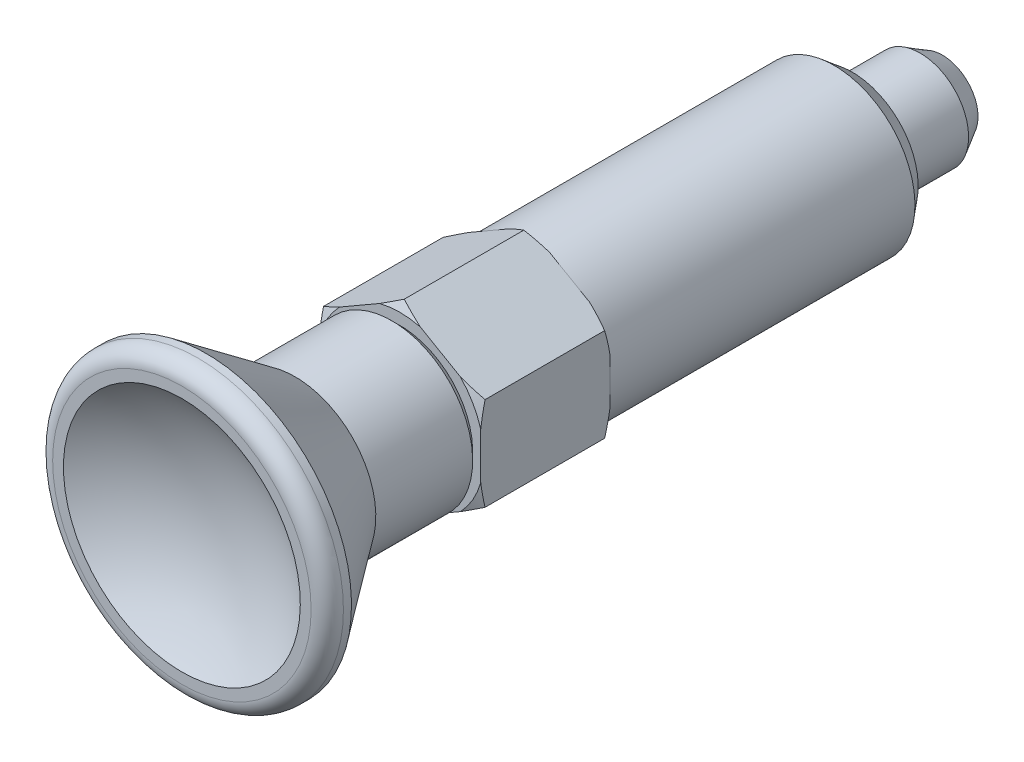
ISO-10303-21;
HEADER;
FILE_DESCRIPTION(('STEP AP214'),'2;1');
FILE_NAME('part.step','',(''),(''),'','','');
FILE_SCHEMA(('AUTOMOTIVE_DESIGN { 1 0 10303 214 1 1 1 1 }'));
ENDSEC;
DATA;
#1=APPLICATION_CONTEXT('core data for automotive mechanical design processes');
#2=APPLICATION_PROTOCOL_DEFINITION('international standard','automotive_design',2000,#1);
#3=PRODUCT_CONTEXT('',#1,'mechanical');
#4=PRODUCT('Part','Part','',(#3));
#5=PRODUCT_RELATED_PRODUCT_CATEGORY('part','',(#4));
#6=PRODUCT_DEFINITION_FORMATION('','',#4);
#7=PRODUCT_DEFINITION_CONTEXT('part definition',#1,'design');
#8=PRODUCT_DEFINITION('design','',#6,#7);
#9=PRODUCT_DEFINITION_SHAPE('','',#8);
#10=(LENGTH_UNIT() NAMED_UNIT(*) SI_UNIT(.MILLI.,.METRE.));
#11=(NAMED_UNIT(*) PLANE_ANGLE_UNIT() SI_UNIT($,.RADIAN.));
#12=(NAMED_UNIT(*) SI_UNIT($,.STERADIAN.) SOLID_ANGLE_UNIT());
#13=UNCERTAINTY_MEASURE_WITH_UNIT(LENGTH_MEASURE(1.E-05),#10,'distance_accuracy_value','');
#14=(GEOMETRIC_REPRESENTATION_CONTEXT(3) GLOBAL_UNCERTAINTY_ASSIGNED_CONTEXT((#13)) GLOBAL_UNIT_ASSIGNED_CONTEXT((#10,
#11,#12)) REPRESENTATION_CONTEXT('',''));
#15=CARTESIAN_POINT('',(0.,0.,0.));
#16=DIRECTION('',(0.,0.,1.));
#17=DIRECTION('',(1.,0.,0.));
#18=AXIS2_PLACEMENT_3D('',#15,#16,#17);
#19=CARTESIAN_POINT('',(0.,0.,0.333098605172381));
#20=DIRECTION('',(0.,0.,1.));
#21=DIRECTION('',(0.,-1.,0.));
#22=AXIS2_PLACEMENT_3D('',#19,#20,#21);
#23=CONICAL_SURFACE('',#22,5.77694370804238,1.04719755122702);
#24=CARTESIAN_POINT('',(5.00000000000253,-1.42828568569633,4.67976352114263E-11));
#25=CARTESIAN_POINT('',(5.00000000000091,-1.55153552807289,0.0195406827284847));
#26=CARTESIAN_POINT('',(5.00000000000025,-1.67440824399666,0.0413696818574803));
#27=CARTESIAN_POINT('',(4.99999999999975,-1.91922440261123,0.0891744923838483));
#28=CARTESIAN_POINT('',(4.99999999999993,-2.04116862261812,0.115146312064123));
#29=CARTESIAN_POINT('',(5.00000000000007,-2.28417102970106,0.170841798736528));
#30=CARTESIAN_POINT('',(5.00000000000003,-2.40522934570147,0.200564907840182));
#31=CARTESIAN_POINT('',(4.99999999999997,-2.64658921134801,0.263399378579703));
#32=CARTESIAN_POINT('',(4.99999999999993,-2.76688992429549,0.296513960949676));
#33=CARTESIAN_POINT('',(5.,-2.88675125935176,0.331111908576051));
#34=B_SPLINE_CURVE_WITH_KNOTS('',3,(#24,#25,#26,#27,#28,#29,#30,#31,#32,#33),.UNSPECIFIED.,.F.,
.F.,(4,2,2,2,4),(0.,0.374326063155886,0.748293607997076,1.12220560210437,1.496476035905),.UNSPECIFIED.);
#35=CARTESIAN_POINT('',(5.,-1.42828568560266,3.34610811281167E-11));
#36=VERTEX_POINT('',#35);
#37=CARTESIAN_POINT('',(5.00000001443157,-2.88675133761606,0.331111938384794));
#38=VERTEX_POINT('',#37);
#39=EDGE_CURVE('E156',#36,#38,#34,.T.);
#40=ORIENTED_EDGE('',*,*,#39,.T.);
#41=CARTESIAN_POINT('',(5.00000000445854,-2.88675130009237,0.331111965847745));
#42=CARTESIAN_POINT('',(4.89619705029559,-2.94668199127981,0.296513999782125));
#43=CARTESIAN_POINT('',(4.79201357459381,-3.00683236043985,0.263399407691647));
#44=CARTESIAN_POINT('',(4.58298978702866,-3.12751230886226,0.200564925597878));
#45=CARTESIAN_POINT('',(4.47815019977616,-3.18804146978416,0.170841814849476));
#46=CARTESIAN_POINT('',(4.26770392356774,-3.30954268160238,0.115146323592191));
#47=CARTESIAN_POINT('',(4.16209712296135,-3.37051479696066,0.089174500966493));
#48=CARTESIAN_POINT('',(3.95008009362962,-3.49292288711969,0.0413696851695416));
#49=CARTESIAN_POINT('',(3.84366919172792,-3.554359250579,0.0195406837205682));
#50=CARTESIAN_POINT('',(3.73693168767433,-3.61598417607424,4.82478640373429E-11));
#51=B_SPLINE_CURVE_WITH_KNOTS('',3,(#41,#42,#43,#44,#45,#46,#47,#48,#49,#50),.UNSPECIFIED.,.F.,
.F.,(4,2,2,2,4),(0.,0.374270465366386,0.748182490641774,1.12215006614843,1.49647616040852),.UNSPECIFIED.);
#52=CARTESIAN_POINT('',(3.73693168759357,-3.61598417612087,3.34610811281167E-11));
#53=VERTEX_POINT('',#52);
#54=EDGE_CURVE('E165',#38,#53,#51,.T.);
#55=ORIENTED_EDGE('',*,*,#54,.T.);
#56=CARTESIAN_POINT('',(0.,0.,1.86448079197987E-11));
#57=DIRECTION('',(0.,0.,1.));
#58=DIRECTION('',(0.,-1.,0.));
#59=AXIS2_PLACEMENT_3D('',#56,#57,#58);
#60=CIRCLE('',#59,5.19999999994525);
#61=EDGE_CURVE('E169',#36,#53,#60,.F.);
#62=ORIENTED_EDGE('',*,*,#61,.F.);
#63=EDGE_LOOP('',(#40,#55,#62));
#64=FACE_BOUND('',#63,.T.);
#65=ADVANCED_FACE('F14',(#64),#23,.T.);
#66=CARTESIAN_POINT('',(0.,0.,0.333098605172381));
#67=DIRECTION('',(0.,0.,1.));
#68=DIRECTION('',(0.,-1.,0.));
#69=AXIS2_PLACEMENT_3D('',#66,#67,#68);
#70=CONICAL_SURFACE('',#69,5.77694370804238,1.04719755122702);
#71=CARTESIAN_POINT('',(1.26306831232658,-5.04426986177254,4.67976352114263E-11));
#72=CARTESIAN_POINT('',(1.15633081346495,-5.10589478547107,0.0195406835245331));
#73=CARTESIAN_POINT('',(1.04991991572,-5.16733114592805,0.0413696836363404));
#74=CARTESIAN_POINT('',(0.837902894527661,-5.28973923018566,0.0891744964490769));
#75=CARTESIAN_POINT('',(0.732296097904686,-5.3507113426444,0.115146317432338));
#76=CARTESIAN_POINT('',(0.521849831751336,-5.47221255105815,0.170841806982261));
#77=CARTESIAN_POINT('',(0.417010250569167,-5.53274171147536,0.200564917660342));
#78=CARTESIAN_POINT('',(0.207986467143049,-5.65342164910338,0.26339939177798));
#79=CARTESIAN_POINT('',(0.103802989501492,-5.7135720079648,0.29651397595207));
#80=CARTESIAN_POINT('',(2.4305155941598E-08,-5.77350267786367,0.331111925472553));
#81=B_SPLINE_CURVE_WITH_KNOTS('',3,(#71,#72,#73,#74,#75,#76,#77,#78,#79,#80),.UNSPECIFIED.,.F.,
.F.,(4,2,2,2,4),(0.,0.374326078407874,0.748293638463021,1.12220564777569,1.49647609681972),.UNSPECIFIED.);
#82=CARTESIAN_POINT('',(1.26306831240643,-5.04426986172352,3.34610811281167E-11));
#83=VERTEX_POINT('',#82);
#84=CARTESIAN_POINT('',(-1.15423198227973E-08,-5.7735026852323,0.331111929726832));
#85=VERTEX_POINT('',#84);
#86=EDGE_CURVE('E876',#83,#85,#81,.T.);
#87=ORIENTED_EDGE('',*,*,#86,.T.);
#88=CARTESIAN_POINT('',(-1.65437970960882E-08,-5.77350266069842,0.331111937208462));
#89=CARTESIAN_POINT('',(-0.103802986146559,-5.71357200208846,0.29651398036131));
#90=CARTESIAN_POINT('',(-0.20798646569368,-5.65342164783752,0.263399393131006));
#91=CARTESIAN_POINT('',(-0.417010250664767,-5.5327417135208,0.200564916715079));
#92=CARTESIAN_POINT('',(-0.521849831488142,-5.47221255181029,0.170841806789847));
#93=CARTESIAN_POINT('',(-0.732296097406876,-5.35071134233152,0.115146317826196));
#94=CARTESIAN_POINT('',(-0.83790289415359,-5.28973923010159,0.0891744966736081));
#95=CARTESIAN_POINT('',(-1.04991991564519,-5.16733114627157,0.0413696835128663));
#96=CARTESIAN_POINT('',(-1.156330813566,-5.10589478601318,0.0195406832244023));
#97=CARTESIAN_POINT('',(-1.26306831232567,-5.04426986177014,4.8246129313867E-11));
#98=B_SPLINE_CURVE_WITH_KNOTS('',3,(#88,#89,#90,#91,#92,#93,#94,#95,#96,#97),.UNSPECIFIED.,.F.,
.F.,(4,2,2,2,4),(0.,0.374270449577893,0.748182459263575,1.12215001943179,1.49647609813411),.UNSPECIFIED.);
#99=CARTESIAN_POINT('',(-1.26306831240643,-5.04426986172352,3.34593464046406E-11));
#100=VERTEX_POINT('',#99);
#101=EDGE_CURVE('E875',#85,#100,#98,.T.);
#102=ORIENTED_EDGE('',*,*,#101,.T.);
#103=CARTESIAN_POINT('',(0.,0.,1.86448079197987E-11));
#104=DIRECTION('',(0.,0.,1.));
#105=DIRECTION('',(0.,-1.,0.));
#106=AXIS2_PLACEMENT_3D('',#103,#104,#105);
#107=CIRCLE('',#106,5.19999999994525);
#108=EDGE_CURVE('E757',#83,#100,#107,.F.);
#109=ORIENTED_EDGE('',*,*,#108,.F.);
#110=EDGE_LOOP('',(#87,#102,#109));
#111=FACE_BOUND('',#110,.T.);
#112=ADVANCED_FACE('F573',(#111),#70,.T.);
#113=CARTESIAN_POINT('',(0.,0.,0.333098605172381));
#114=DIRECTION('',(0.,0.,1.));
#115=DIRECTION('',(0.,-1.,0.));
#116=AXIS2_PLACEMENT_3D('',#113,#114,#115);
#117=CONICAL_SURFACE('',#116,5.77694370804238,1.04719755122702);
#118=CARTESIAN_POINT('',(-4.99999996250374,-2.8867513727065,0.331111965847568));
#119=CARTESIAN_POINT('',(-4.99999998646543,-2.76689003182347,0.29651399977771));
#120=CARTESIAN_POINT('',(-4.99999999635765,-2.646589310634,0.263399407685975));
#121=CARTESIAN_POINT('',(-5.00000000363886,-2.4052294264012,0.200564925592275));
#122=CARTESIAN_POINT('',(-5.00000000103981,-2.2841711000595,0.170841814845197));
#123=CARTESIAN_POINT('',(-4.99999999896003,-2.04116867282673,0.115146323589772));
#124=CARTESIAN_POINT('',(-4.99999999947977,-1.91922444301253,0.0891745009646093));
#125=CARTESIAN_POINT('',(-5.00000000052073,-1.67440826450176,0.0413696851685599));
#126=CARTESIAN_POINT('',(-5.00000000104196,-1.55153553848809,0.019540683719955));
#127=CARTESIAN_POINT('',(-5.,-1.42828568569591,4.82478640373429E-11));
#128=B_SPLINE_CURVE_WITH_KNOTS('',3,(#118,#119,#120,#121,#122,#123,#124,#125,#126,#127),
.UNSPECIFIED.,.F.,.F.,(4,2,2,2,4),(0.,0.374270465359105,0.748182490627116,1.12215006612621,
1.49647616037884),.UNSPECIFIED.);
#129=CARTESIAN_POINT('',(-5.,-2.88675136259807,0.331111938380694));
#130=VERTEX_POINT('',#129);
#131=CARTESIAN_POINT('',(-5.,-1.42828568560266,3.34593464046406E-11));
#132=VERTEX_POINT('',#131);
#133=EDGE_CURVE('E809',#130,#132,#128,.T.);
#134=ORIENTED_EDGE('',*,*,#133,.T.);
#135=CARTESIAN_POINT('',(0.,0.,1.86448079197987E-11));
#136=DIRECTION('',(0.,0.,1.));
#137=DIRECTION('',(0.,-1.,0.));
#138=AXIS2_PLACEMENT_3D('',#135,#136,#137);
#139=CIRCLE('',#138,5.19999999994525);
#140=CARTESIAN_POINT('',(-3.73693168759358,-3.61598417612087,3.34593464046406E-11));
#141=VERTEX_POINT('',#140);
#142=EDGE_CURVE('E754',#141,#132,#139,.F.);
#143=ORIENTED_EDGE('',*,*,#142,.F.);
#144=CARTESIAN_POINT('',(-3.73693168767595,-3.61598417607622,4.67976352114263E-11));
#145=CARTESIAN_POINT('',(-3.84366918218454,-3.5543592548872,0.0195406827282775));
#146=CARTESIAN_POINT('',(-3.95008007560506,-3.49292289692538,0.0413696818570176));
#147=CARTESIAN_POINT('',(-4.16209708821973,-3.37051481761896,0.0891744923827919));
#148=CARTESIAN_POINT('',(-4.26770388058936,-3.3095427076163,0.115146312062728));
#149=CARTESIAN_POINT('',(-4.47815013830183,-3.18804150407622,0.170841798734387));
#150=CARTESIAN_POINT('',(-4.58298971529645,-3.12751234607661,0.200564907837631));
#151=CARTESIAN_POINT('',(-4.79201349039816,-3.00683241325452,0.263399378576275));
#152=CARTESIAN_POINT('',(-4.89619696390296,-2.94668205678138,0.29651396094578));
#153=CARTESIAN_POINT('',(-4.99999992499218,-2.88675138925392,0.331111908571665));
#154=B_SPLINE_CURVE_WITH_KNOTS('',3,(#144,#145,#146,#147,#148,#149,#150,#151,#152,#153),
.UNSPECIFIED.,.F.,.F.,(4,2,2,2,4),(0.,0.374326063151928,0.748293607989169,1.12220560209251,
1.49647603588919),.UNSPECIFIED.);
#155=EDGE_CURVE('E872',#141,#130,#154,.T.);
#156=ORIENTED_EDGE('',*,*,#155,.T.);
#157=EDGE_LOOP('',(#134,#143,#156));
#158=FACE_BOUND('',#157,.T.);
#159=ADVANCED_FACE('F563',(#158),#117,.T.);
#160=CARTESIAN_POINT('',(0.,0.,0.333098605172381));
#161=DIRECTION('',(0.,0.,1.));
#162=DIRECTION('',(0.,-1.,0.));
#163=AXIS2_PLACEMENT_3D('',#160,#161,#162);
#164=CONICAL_SURFACE('',#163,5.77694370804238,1.04719755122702);
#165=CARTESIAN_POINT('',(-5.00000000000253,1.42828568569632,4.67993699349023E-11));
#166=CARTESIAN_POINT('',(-5.00000000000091,1.55153552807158,0.0195406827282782));
#167=CARTESIAN_POINT('',(-5.00000000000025,1.67440824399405,0.0413696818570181));
#168=CARTESIAN_POINT('',(-4.99999999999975,1.91922440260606,0.0891744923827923));
#169=CARTESIAN_POINT('',(-4.99999999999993,2.04116862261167,0.115146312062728));
#170=CARTESIAN_POINT('',(-5.00000000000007,2.28417102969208,0.170841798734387));
#171=CARTESIAN_POINT('',(-5.00000000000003,2.40522934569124,0.200564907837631));
#172=CARTESIAN_POINT('',(-4.99999999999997,2.64658921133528,0.263399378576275));
#173=CARTESIAN_POINT('',(-4.99999999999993,2.76688992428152,0.29651396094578));
#174=CARTESIAN_POINT('',(-5.,2.88675125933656,0.331111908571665));
#175=B_SPLINE_CURVE_WITH_KNOTS('',3,(#165,#166,#167,#168,#169,#170,#171,#172,#173,#174),
.UNSPECIFIED.,.F.,.F.,(4,2,2,2,4),(0.,0.374326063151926,0.748293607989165,1.12220560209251,
1.49647603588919),.UNSPECIFIED.);
#176=CARTESIAN_POINT('',(-5.,1.42828568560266,3.34610811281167E-11));
#177=VERTEX_POINT('',#176);
#178=CARTESIAN_POINT('',(-5.00000001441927,2.88675133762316,0.331111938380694));
#179=VERTEX_POINT('',#178);
#180=EDGE_CURVE('E802',#177,#179,#175,.T.);
#181=ORIENTED_EDGE('',*,*,#180,.T.);
#182=CARTESIAN_POINT('',(-5.0000000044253,2.88675130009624,0.331111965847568));
#183=CARTESIAN_POINT('',(-4.89619705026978,2.94668199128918,0.296513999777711));
#184=CARTESIAN_POINT('',(-4.79201357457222,3.00683236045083,0.263399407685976));
#185=CARTESIAN_POINT('',(-4.58298978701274,3.12751230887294,0.200564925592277));
#186=CARTESIAN_POINT('',(-4.47815019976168,3.18804146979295,0.170841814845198));
#187=CARTESIAN_POINT('',(-4.26770392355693,3.3095426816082,0.115146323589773));
#188=CARTESIAN_POINT('',(-4.16209712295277,3.3705147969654,0.0891745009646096));
#189=CARTESIAN_POINT('',(-3.9500800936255,3.49292288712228,0.0413696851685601));
#190=CARTESIAN_POINT('',(-3.84366919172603,3.55435925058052,0.0195406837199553));
#191=CARTESIAN_POINT('',(-3.73693168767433,3.61598417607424,4.82478640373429E-11));
#192=B_SPLINE_CURVE_WITH_KNOTS('',3,(#182,#183,#184,#185,#186,#187,#188,#189,#190,#191),
.UNSPECIFIED.,.F.,.F.,(4,2,2,2,4),(0.,0.374270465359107,0.748182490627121,1.12215006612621,
1.49647616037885),.UNSPECIFIED.);
#193=CARTESIAN_POINT('',(-3.73693168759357,3.61598417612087,3.34610811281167E-11));
#194=VERTEX_POINT('',#193);
#195=EDGE_CURVE('E796',#179,#194,#192,.T.);
#196=ORIENTED_EDGE('',*,*,#195,.T.);
#197=CARTESIAN_POINT('',(0.,0.,1.86448079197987E-11));
#198=DIRECTION('',(0.,0.,1.));
#199=DIRECTION('',(0.,-1.,0.));
#200=AXIS2_PLACEMENT_3D('',#197,#198,#199);
#201=CIRCLE('',#200,5.19999999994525);
#202=EDGE_CURVE('E744',#177,#194,#201,.F.);
#203=ORIENTED_EDGE('',*,*,#202,.F.);
#204=EDGE_LOOP('',(#181,#196,#203));
#205=FACE_BOUND('',#204,.T.);
#206=ADVANCED_FACE('F553',(#205),#164,.T.);
#207=CARTESIAN_POINT('',(0.,0.,0.333098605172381));
#208=DIRECTION('',(0.,0.,1.));
#209=DIRECTION('',(0.,-1.,0.));
#210=AXIS2_PLACEMENT_3D('',#207,#208,#209);
#211=CONICAL_SURFACE('',#210,5.77694370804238,1.04719755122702);
#212=CARTESIAN_POINT('',(-1.26306831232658,5.04426986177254,4.67993699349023E-11));
#213=CARTESIAN_POINT('',(-1.15633081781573,5.10589478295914,0.0195406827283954));
#214=CARTESIAN_POINT('',(-1.04991992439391,5.16733114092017,0.0413696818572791));
#215=CARTESIAN_POINT('',(-0.837902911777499,5.28973922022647,0.0891744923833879));
#216=CARTESIAN_POINT('',(-0.732296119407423,5.35071133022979,0.115146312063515));
#217=CARTESIAN_POINT('',(-0.521849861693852,5.47221253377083,0.170841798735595));
#218=CARTESIAN_POINT('',(-0.417010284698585,5.53274169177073,0.20056490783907));
#219=CARTESIAN_POINT('',(-0.207986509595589,5.6534216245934,0.263399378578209));
#220=CARTESIAN_POINT('',(-0.103803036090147,5.71357198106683,0.296513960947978));
#221=CARTESIAN_POINT('',(-7.50003948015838E-08,5.77350264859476,0.33111190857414));
#222=B_SPLINE_CURVE_WITH_KNOTS('',3,(#212,#213,#214,#215,#216,#217,#218,#219,#220,#221),
.UNSPECIFIED.,.F.,.F.,(4,2,2,2,4),(0.,0.374326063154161,0.748293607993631,1.1222056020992,
1.49647603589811),.UNSPECIFIED.);
#223=CARTESIAN_POINT('',(-1.26306831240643,5.04426986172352,3.34610811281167E-11));
#224=VERTEX_POINT('',#223);
#225=CARTESIAN_POINT('',(-1.44155937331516E-08,5.77350270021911,0.331111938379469));
#226=VERTEX_POINT('',#225);
#227=EDGE_CURVE('E182',#224,#226,#222,.T.);
#228=ORIENTED_EDGE('',*,*,#227,.T.);
#229=CARTESIAN_POINT('',(-4.1913278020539E-08,5.77350267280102,0.331111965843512));
#230=CARTESIAN_POINT('',(0.103802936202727,5.71357202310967,0.296513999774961));
#231=CARTESIAN_POINT('',(0.207986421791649,5.65342167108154,0.263399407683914));
#232=CARTESIAN_POINT('',(0.417010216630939,5.53274173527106,0.200564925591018));
#233=CARTESIAN_POINT('',(0.521849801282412,5.47221256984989,0.170841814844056));
#234=CARTESIAN_POINT('',(0.732296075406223,5.3507113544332,0.115146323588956));
#235=CARTESIAN_POINT('',(0.837902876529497,5.28973923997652,0.0891745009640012));
#236=CARTESIAN_POINT('',(1.04991990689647,5.16733115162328,0.0413696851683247));
#237=CARTESIAN_POINT('',(1.15633080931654,5.10589478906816,0.0195406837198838));
#238=CARTESIAN_POINT('',(1.26306831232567,5.04426986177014,4.8246129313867E-11));
#239=B_SPLINE_CURVE_WITH_KNOTS('',3,(#229,#230,#231,#232,#233,#234,#235,#236,#237,#238),
.UNSPECIFIED.,.F.,.F.,(4,2,2,2,4),(0.,0.374270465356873,0.748182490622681,1.1221500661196,
1.49647616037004),.UNSPECIFIED.);
#240=CARTESIAN_POINT('',(1.26306831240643,5.04426986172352,3.34593464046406E-11));
#241=VERTEX_POINT('',#240);
#242=EDGE_CURVE('E180',#226,#241,#239,.T.);
#243=ORIENTED_EDGE('',*,*,#242,.T.);
#244=CARTESIAN_POINT('',(0.,0.,1.86448079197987E-11));
#245=DIRECTION('',(0.,0.,1.));
#246=DIRECTION('',(0.,-1.,0.));
#247=AXIS2_PLACEMENT_3D('',#244,#245,#246);
#248=CIRCLE('',#247,5.19999999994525);
#249=EDGE_CURVE('E737',#224,#241,#248,.F.);
#250=ORIENTED_EDGE('',*,*,#249,.F.);
#251=EDGE_LOOP('',(#228,#243,#250));
#252=FACE_BOUND('',#251,.T.);
#253=ADVANCED_FACE('F544',(#252),#211,.T.);
#254=CARTESIAN_POINT('',(5.,0.,0.));
#255=DIRECTION('',(0.,0.,-1.));
#256=DIRECTION('',(0.,1.,0.));
#257=AXIS2_PLACEMENT_3D('',#254,#255,#256);
#258=PLANE('',#257);
#259=ORIENTED_EDGE('',*,*,#61,.T.);
#260=DIRECTION('',(-0.866025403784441,-0.5,0.));
#261=VECTOR('',#260,1.);
#262=CARTESIAN_POINT('',(3.7369316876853,-3.61598417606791,0.));
#263=LINE('',#262,#261);
#264=CARTESIAN_POINT('',(2.5,-4.3301270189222,0.));
#265=VERTEX_POINT('',#264);
#266=EDGE_CURVE('E174',#53,#265,#263,.T.);
#267=ORIENTED_EDGE('',*,*,#266,.T.);
#268=CARTESIAN_POINT('',(0.,0.,0.));
#269=DIRECTION('',(0.,0.,1.));
#270=DIRECTION('',(0.,-1.,0.));
#271=AXIS2_PLACEMENT_3D('',#268,#269,#270);
#272=CIRCLE('',#271,5.);
#273=CARTESIAN_POINT('',(5.,0.,0.));
#274=VERTEX_POINT('',#273);
#275=EDGE_CURVE('E178',#274,#265,#272,.F.);
#276=ORIENTED_EDGE('',*,*,#275,.F.);
#277=DIRECTION('',(0.,1.,0.));
#278=VECTOR('',#277,1.);
#279=CARTESIAN_POINT('',(5.,0.,0.));
#280=LINE('',#279,#278);
#281=EDGE_CURVE('E160',#274,#36,#280,.F.);
#282=ORIENTED_EDGE('',*,*,#281,.T.);
#283=EDGE_LOOP('',(#259,#267,#276,#282));
#284=FACE_BOUND('',#283,.T.);
#285=ADVANCED_FACE('F176',(#284),#258,.T.);
#286=CARTESIAN_POINT('',(5.,0.,0.));
#287=DIRECTION('',(0.,0.,-1.));
#288=DIRECTION('',(0.,1.,0.));
#289=AXIS2_PLACEMENT_3D('',#286,#287,#288);
#290=PLANE('',#289);
#291=ORIENTED_EDGE('',*,*,#108,.T.);
#292=DIRECTION('',(-0.866025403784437,0.5,0.));
#293=VECTOR('',#292,1.);
#294=CARTESIAN_POINT('',(-1.2630683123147,-5.04426986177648,0.));
#295=LINE('',#294,#293);
#296=CARTESIAN_POINT('',(-2.5,-4.33012701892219,0.));
#297=VERTEX_POINT('',#296);
#298=EDGE_CURVE('E755',#100,#297,#295,.T.);
#299=ORIENTED_EDGE('',*,*,#298,.T.);
#300=CARTESIAN_POINT('',(0.,0.,0.));
#301=DIRECTION('',(0.,0.,1.));
#302=DIRECTION('',(0.,-1.,0.));
#303=AXIS2_PLACEMENT_3D('',#300,#301,#302);
#304=CIRCLE('',#303,5.);
#305=EDGE_CURVE('E764',#265,#297,#304,.F.);
#306=ORIENTED_EDGE('',*,*,#305,.F.);
#307=DIRECTION('',(-0.866025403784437,-0.5,0.));
#308=VECTOR('',#307,1.);
#309=CARTESIAN_POINT('',(2.5,-4.33012701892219,0.));
#310=LINE('',#309,#308);
#311=EDGE_CURVE('E758',#265,#83,#310,.T.);
#312=ORIENTED_EDGE('',*,*,#311,.T.);
#313=EDGE_LOOP('',(#291,#299,#306,#312));
#314=FACE_BOUND('',#313,.T.);
#315=ADVANCED_FACE('F525',(#314),#290,.T.);
#316=CARTESIAN_POINT('',(5.,0.,0.));
#317=DIRECTION('',(0.,0.,-1.));
#318=DIRECTION('',(0.,1.,0.));
#319=AXIS2_PLACEMENT_3D('',#316,#317,#318);
#320=PLANE('',#319);
#321=CARTESIAN_POINT('',(0.,0.,0.));
#322=DIRECTION('',(0.,0.,1.));
#323=DIRECTION('',(0.,-1.,0.));
#324=AXIS2_PLACEMENT_3D('',#321,#322,#323);
#325=CIRCLE('',#324,5.);
#326=CARTESIAN_POINT('',(-5.,0.,0.));
#327=VERTEX_POINT('',#326);
#328=EDGE_CURVE('E768',#297,#327,#325,.F.);
#329=ORIENTED_EDGE('',*,*,#328,.F.);
#330=DIRECTION('',(-0.866025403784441,0.5,0.));
#331=VECTOR('',#330,1.);
#332=CARTESIAN_POINT('',(-2.5,-4.33012701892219,0.));
#333=LINE('',#332,#331);
#334=EDGE_CURVE('E748',#297,#141,#333,.T.);
#335=ORIENTED_EDGE('',*,*,#334,.T.);
#336=ORIENTED_EDGE('',*,*,#142,.T.);
#337=DIRECTION('',(0.,1.,0.));
#338=VECTOR('',#337,1.);
#339=CARTESIAN_POINT('',(-5.,0.,0.));
#340=LINE('',#339,#338);
#341=EDGE_CURVE('E751',#132,#327,#340,.T.);
#342=ORIENTED_EDGE('',*,*,#341,.T.);
#343=EDGE_LOOP('',(#329,#335,#336,#342));
#344=FACE_BOUND('',#343,.T.);
#345=ADVANCED_FACE('F515',(#344),#320,.T.);
#346=CARTESIAN_POINT('',(5.,0.,0.));
#347=DIRECTION('',(0.,0.,-1.));
#348=DIRECTION('',(0.,1.,0.));
#349=AXIS2_PLACEMENT_3D('',#346,#347,#348);
#350=PLANE('',#349);
#351=ORIENTED_EDGE('',*,*,#202,.T.);
#352=DIRECTION('',(0.866025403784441,0.5,0.));
#353=VECTOR('',#352,1.);
#354=CARTESIAN_POINT('',(-3.7369316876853,3.61598417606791,0.));
#355=LINE('',#354,#353);
#356=CARTESIAN_POINT('',(-2.5,4.33012701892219,0.));
#357=VERTEX_POINT('',#356);
#358=EDGE_CURVE('E741',#194,#357,#355,.T.);
#359=ORIENTED_EDGE('',*,*,#358,.T.);
#360=CARTESIAN_POINT('',(0.,0.,0.));
#361=DIRECTION('',(0.,0.,1.));
#362=DIRECTION('',(0.,-1.,0.));
#363=AXIS2_PLACEMENT_3D('',#360,#361,#362);
#364=CIRCLE('',#363,5.);
#365=EDGE_CURVE('E868',#327,#357,#364,.F.);
#366=ORIENTED_EDGE('',*,*,#365,.F.);
#367=DIRECTION('',(0.,1.,0.));
#368=VECTOR('',#367,1.);
#369=CARTESIAN_POINT('',(-5.,0.,0.));
#370=LINE('',#369,#368);
#371=EDGE_CURVE('E745',#327,#177,#370,.T.);
#372=ORIENTED_EDGE('',*,*,#371,.T.);
#373=EDGE_LOOP('',(#351,#359,#366,#372));
#374=FACE_BOUND('',#373,.T.);
#375=ADVANCED_FACE('F505',(#374),#350,.T.);
#376=CARTESIAN_POINT('',(5.,0.,0.));
#377=DIRECTION('',(0.,0.,-1.));
#378=DIRECTION('',(0.,1.,0.));
#379=AXIS2_PLACEMENT_3D('',#376,#377,#378);
#380=PLANE('',#379);
#381=ORIENTED_EDGE('',*,*,#249,.T.);
#382=DIRECTION('',(0.866025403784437,-0.5,0.));
#383=VECTOR('',#382,1.);
#384=CARTESIAN_POINT('',(1.2630683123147,5.04426986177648,0.));
#385=LINE('',#384,#383);
#386=CARTESIAN_POINT('',(2.5,4.3301270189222,0.));
#387=VERTEX_POINT('',#386);
#388=EDGE_CURVE('E735',#241,#387,#385,.T.);
#389=ORIENTED_EDGE('',*,*,#388,.T.);
#390=CARTESIAN_POINT('',(0.,0.,0.));
#391=DIRECTION('',(0.,0.,1.));
#392=DIRECTION('',(0.,-1.,0.));
#393=AXIS2_PLACEMENT_3D('',#390,#391,#392);
#394=CIRCLE('',#393,5.);
#395=EDGE_CURVE('E967',#357,#387,#394,.F.);
#396=ORIENTED_EDGE('',*,*,#395,.F.);
#397=DIRECTION('',(0.866025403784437,0.5,0.));
#398=VECTOR('',#397,1.);
#399=CARTESIAN_POINT('',(-2.5,4.33012701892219,0.));
#400=LINE('',#399,#398);
#401=EDGE_CURVE('E738',#357,#224,#400,.T.);
#402=ORIENTED_EDGE('',*,*,#401,.T.);
#403=EDGE_LOOP('',(#381,#389,#396,#402));
#404=FACE_BOUND('',#403,.T.);
#405=ADVANCED_FACE('F495',(#404),#380,.T.);
#406=CARTESIAN_POINT('',(0.,0.,-20.));
#407=DIRECTION('',(0.,0.,1.));
#408=DIRECTION('',(0.,-1.,0.));
#409=AXIS2_PLACEMENT_3D('',#406,#407,#408);
#410=CYLINDRICAL_SURFACE('',#409,5.);
#411=ORIENTED_EDGE('',*,*,#365,.T.);
#412=ORIENTED_EDGE('',*,*,#395,.T.);
#413=CARTESIAN_POINT('',(0.,0.,0.));
#414=DIRECTION('',(0.,0.,1.));
#415=DIRECTION('',(0.,-1.,0.));
#416=AXIS2_PLACEMENT_3D('',#413,#414,#415);
#417=CIRCLE('',#416,5.);
#418=EDGE_CURVE('E731',#274,#387,#417,.T.);
#419=ORIENTED_EDGE('',*,*,#418,.F.);
#420=ORIENTED_EDGE('',*,*,#275,.T.);
#421=ORIENTED_EDGE('',*,*,#305,.T.);
#422=ORIENTED_EDGE('',*,*,#328,.T.);
#423=EDGE_LOOP('',(#411,#412,#419,#420,#421,#422));
#424=FACE_BOUND('',#423,.T.);
#425=CARTESIAN_POINT('',(0.,0.,-18.88));
#426=DIRECTION('',(0.,0.,1.));
#427=DIRECTION('',(0.,-1.,0.));
#428=AXIS2_PLACEMENT_3D('',#425,#426,#427);
#429=CIRCLE('',#428,5.);
#430=CARTESIAN_POINT('',(0.,-5.,-18.88));
#431=VERTEX_POINT('',#430);
#432=EDGE_CURVE('E166',#431,#431,#429,.T.);
#433=ORIENTED_EDGE('',*,*,#432,.T.);
#434=EDGE_LOOP('',(#433));
#435=FACE_BOUND('',#434,.T.);
#436=ADVANCED_FACE('F485',(#424,#435),#410,.T.);
#437=CARTESIAN_POINT('',(5.,0.,0.));
#438=DIRECTION('',(0.,0.,-1.));
#439=DIRECTION('',(0.,1.,0.));
#440=AXIS2_PLACEMENT_3D('',#437,#438,#439);
#441=PLANE('',#440);
#442=CARTESIAN_POINT('',(0.,0.,1.86448079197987E-11));
#443=DIRECTION('',(0.,0.,1.));
#444=DIRECTION('',(0.,-1.,0.));
#445=AXIS2_PLACEMENT_3D('',#442,#443,#444);
#446=CIRCLE('',#445,5.19999999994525);
#447=CARTESIAN_POINT('',(5.,1.42828568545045,9.32240395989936E-12));
#448=VERTEX_POINT('',#447);
#449=CARTESIAN_POINT('',(3.73693168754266,3.61598417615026,2.41369424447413E-11));
#450=VERTEX_POINT('',#449);
#451=EDGE_CURVE('E692',#448,#450,#446,.T.);
#452=ORIENTED_EDGE('',*,*,#451,.F.);
#453=DIRECTION('',(0.,1.,0.));
#454=VECTOR('',#453,1.);
#455=CARTESIAN_POINT('',(5.,0.,0.));
#456=LINE('',#455,#454);
#457=EDGE_CURVE('E722',#448,#274,#456,.F.);
#458=ORIENTED_EDGE('',*,*,#457,.T.);
#459=ORIENTED_EDGE('',*,*,#418,.T.);
#460=DIRECTION('',(0.866025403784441,-0.5,0.));
#461=VECTOR('',#460,1.);
#462=CARTESIAN_POINT('',(2.5,4.33012701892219,0.));
#463=LINE('',#462,#461);
#464=EDGE_CURVE('E728',#387,#450,#463,.T.);
#465=ORIENTED_EDGE('',*,*,#464,.T.);
#466=EDGE_LOOP('',(#452,#458,#459,#465));
#467=FACE_BOUND('',#466,.T.);
#468=ADVANCED_FACE('F475',(#467),#441,.T.);
#469=CARTESIAN_POINT('',(0.,0.,0.333098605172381));
#470=DIRECTION('',(0.,0.,1.));
#471=DIRECTION('',(0.,-1.,0.));
#472=AXIS2_PLACEMENT_3D('',#469,#470,#471);
#473=CONICAL_SURFACE('',#472,5.77694370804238,1.04719755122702);
#474=CARTESIAN_POINT('',(3.73693168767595,3.61598417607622,4.67976352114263E-11));
#475=CARTESIAN_POINT('',(3.84366918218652,3.55435925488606,0.0195406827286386));
#476=CARTESIAN_POINT('',(3.950080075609,3.49292289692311,0.041369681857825));
#477=CARTESIAN_POINT('',(4.16209708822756,3.37051481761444,0.0891744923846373));
#478=CARTESIAN_POINT('',(4.26770388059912,3.30954270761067,0.115146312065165));
#479=CARTESIAN_POINT('',(4.47815013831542,3.18804150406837,0.17084179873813));
#480=CARTESIAN_POINT('',(4.58298971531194,3.12751234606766,0.200564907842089));
#481=CARTESIAN_POINT('',(4.79201349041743,3.0068324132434,0.263399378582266));
#482=CARTESIAN_POINT('',(4.89619696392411,2.94668205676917,0.29651396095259));
#483=CARTESIAN_POINT('',(4.99999992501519,2.88675138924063,0.331111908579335));
#484=B_SPLINE_CURVE_WITH_KNOTS('',3,(#474,#475,#476,#477,#478,#479,#480,#481,#482,#483),
.UNSPECIFIED.,.F.,.F.,(4,2,2,2,4),(0.,0.374326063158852,0.748293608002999,1.12220560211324,
1.49647603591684),.UNSPECIFIED.);
#485=CARTESIAN_POINT('',(4.9999999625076,2.88675138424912,0.331111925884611));
#486=VERTEX_POINT('',#485);
#487=EDGE_CURVE('E686',#450,#486,#484,.T.);
#488=ORIENTED_EDGE('',*,*,#487,.T.);
#489=CARTESIAN_POINT('',(5.0000000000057,1.42828568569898,4.53161813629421E-11));
#490=CARTESIAN_POINT('',(5.00000000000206,1.55153553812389,0.0195406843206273));
#491=CARTESIAN_POINT('',(5.00000000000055,1.67440826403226,0.0413696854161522));
#492=CARTESIAN_POINT('',(4.99999999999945,1.91922444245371,0.0891745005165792));
#493=CARTESIAN_POINT('',(4.99999999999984,2.04116867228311,0.115146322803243));
#494=CARTESIAN_POINT('',(5.00000000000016,2.2841710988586,0.170841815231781));
#495=CARTESIAN_POINT('',(5.00000000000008,2.40522942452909,0.200564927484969));
#496=CARTESIAN_POINT('',(4.99999999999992,2.64658930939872,0.263399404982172));
#497=CARTESIAN_POINT('',(4.99999999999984,2.76689003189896,0.296513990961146));
#498=CARTESIAN_POINT('',(5.,2.88675137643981,0.331111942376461));
#499=B_SPLINE_CURVE_WITH_KNOTS('',3,(#489,#490,#491,#492,#493,#494,#495,#496,#497,#498),
.UNSPECIFIED.,.F.,.F.,(4,2,2,2,4),(0.,0.374326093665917,0.748293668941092,1.12220569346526,
1.49647615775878),.UNSPECIFIED.);
#500=EDGE_CURVE('E674',#448,#486,#499,.T.);
#501=ORIENTED_EDGE('',*,*,#500,.F.);
#502=ORIENTED_EDGE('',*,*,#451,.T.);
#503=EDGE_LOOP('',(#488,#501,#502));
#504=FACE_BOUND('',#503,.T.);
#505=ADVANCED_FACE('F465',(#504),#473,.T.);
#506=CARTESIAN_POINT('',(0.,0.,7.73096673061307));
#507=DIRECTION('',(0.,0.,-1.));
#508=DIRECTION('',(0.,1.,0.));
#509=AXIS2_PLACEMENT_3D('',#506,#507,#508);
#510=CONICAL_SURFACE('',#509,5.77694370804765,1.13446401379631);
#511=CARTESIAN_POINT('',(5.,-1.42828568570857,8.));
#512=CARTESIAN_POINT('',(5.,-1.55095406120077,7.98429231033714));
#513=CARTESIAN_POINT('',(5.,-1.67337716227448,7.96673685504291));
#514=CARTESIAN_POINT('',(5.,-1.91761064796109,7.92824367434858));
#515=CARTESIAN_POINT('',(5.,-2.03942137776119,7.90730814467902));
#516=CARTESIAN_POINT('',(5.,-2.28245488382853,7.86234917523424));
#517=CARTESIAN_POINT('',(5.,-2.40367771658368,7.83832603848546));
#518=CARTESIAN_POINT('',(5.,-2.64561682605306,7.78747519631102));
#519=CARTESIAN_POINT('',(5.,-2.76633272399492,7.76064568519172));
#520=CARTESIAN_POINT('',(5.,-2.88675134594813,7.7325713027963));
#521=B_SPLINE_CURVE_WITH_KNOTS('',3,(#511,#512,#513,#514,#515,#516,#517,#518,#519,#520),
.UNSPECIFIED.,.F.,.F.,(4,2,2,2,4),(0.,0.370983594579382,0.74172715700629,1.11243436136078,
1.48338157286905),.UNSPECIFIED.);
#522=CARTESIAN_POINT('',(5.,-1.42828568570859,8.));
#523=VERTEX_POINT('',#522);
#524=CARTESIAN_POINT('',(5.,-2.88675134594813,7.73257130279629));
#525=VERTEX_POINT('',#524);
#526=EDGE_CURVE('E680',#523,#525,#521,.T.);
#527=ORIENTED_EDGE('',*,*,#526,.F.);
#528=CARTESIAN_POINT('',(0.,0.,8.));
#529=DIRECTION('',(0.,0.,-1.));
#530=DIRECTION('',(0.,1.,0.));
#531=AXIS2_PLACEMENT_3D('',#528,#529,#530);
#532=CIRCLE('',#531,5.2);
#533=CARTESIAN_POINT('',(3.73693168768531,-3.6159841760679,8.));
#534=VERTEX_POINT('',#533);
#535=EDGE_CURVE('E914',#534,#523,#532,.F.);
#536=ORIENTED_EDGE('',*,*,#535,.F.);
#537=CARTESIAN_POINT('',(5.,-2.88675134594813,7.73257130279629));
#538=CARTESIAN_POINT('',(4.8957144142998,-2.94696065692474,7.76064568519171));
#539=CARTESIAN_POINT('',(4.7911713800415,-3.00731860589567,7.78747519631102));
#540=CARTESIAN_POINT('',(4.58164596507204,-3.12828816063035,7.83832603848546));
#541=CARTESIAN_POINT('',(4.47666391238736,-3.18889957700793,7.86234917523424));
#542=CARTESIAN_POINT('',(4.26619072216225,-3.3104163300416,7.90730814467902));
#543=CARTESIAN_POINT('',(4.16069953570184,-3.37132169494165,7.92824367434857));
#544=CARTESIAN_POINT('',(3.94918713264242,-3.49343843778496,7.96673685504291));
#545=CARTESIAN_POINT('',(3.84316561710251,-3.55464998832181,7.98429231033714));
#546=CARTESIAN_POINT('',(3.73693168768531,-3.61598417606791,8.));
#547=B_SPLINE_CURVE_WITH_KNOTS('',3,(#537,#538,#539,#540,#541,#542,#543,#544,#545,#546),
.UNSPECIFIED.,.F.,.F.,(4,2,2,2,4),(0.,0.370947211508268,0.741654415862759,1.11239797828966,
1.48338157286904),.UNSPECIFIED.);
#548=EDGE_CURVE('E911',#525,#534,#547,.T.);
#549=ORIENTED_EDGE('',*,*,#548,.F.);
#550=EDGE_LOOP('',(#527,#536,#549));
#551=FACE_BOUND('',#550,.T.);
#552=ADVANCED_FACE('F456',(#551),#510,.T.);
#553=CARTESIAN_POINT('',(5.,-2.88675134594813,0.));
#554=DIRECTION('',(1.,0.,0.));
#555=DIRECTION('',(0.,1.,0.));
#556=AXIS2_PLACEMENT_3D('',#553,#554,#555);
#557=PLANE('',#556);
#558=ORIENTED_EDGE('',*,*,#457,.F.);
#559=ORIENTED_EDGE('',*,*,#500,.T.);
#560=DIRECTION('',(0.,0.,1.));
#561=VECTOR('',#560,1.);
#562=CARTESIAN_POINT('',(5.,2.88675134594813,0.));
#563=LINE('',#562,#561);
#564=CARTESIAN_POINT('',(5.,2.88675130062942,7.73257131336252));
#565=VERTEX_POINT('',#564);
#566=EDGE_CURVE('E713',#565,#486,#563,.F.);
#567=ORIENTED_EDGE('',*,*,#566,.F.);
#568=CARTESIAN_POINT('',(5.,1.42828568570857,8.));
#569=CARTESIAN_POINT('',(5.,1.55095405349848,7.98429231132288));
#570=CARTESIAN_POINT('',(5.,1.67337714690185,7.96673685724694));
#571=CARTESIAN_POINT('',(5.,1.91761061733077,7.92824367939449));
#572=CARTESIAN_POINT('',(5.,2.03942133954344,7.90730815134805));
#573=CARTESIAN_POINT('',(5.,2.28245483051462,7.86234918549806));
#574=CARTESIAN_POINT('',(5.,2.40367765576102,7.83832605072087));
#575=CARTESIAN_POINT('',(5.,2.64561675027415,7.7874752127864));
#576=CARTESIAN_POINT('',(5.,2.7663326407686,7.76064570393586));
#577=CARTESIAN_POINT('',(5.,2.88675125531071,7.73257132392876));
#578=B_SPLINE_CURVE_WITH_KNOTS('',3,(#568,#569,#570,#571,#572,#573,#574,#575,#576,#577),
.UNSPECIFIED.,.F.,.F.,(4,2,2,2,4),(0.,0.370983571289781,0.741727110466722,1.11243429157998,
1.4833814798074),.UNSPECIFIED.);
#579=CARTESIAN_POINT('',(5.,1.42828568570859,8.));
#580=VERTEX_POINT('',#579);
#581=EDGE_CURVE('E666',#580,#565,#578,.T.);
#582=ORIENTED_EDGE('',*,*,#581,.F.);
#583=DIRECTION('',(0.,-1.,0.));
#584=VECTOR('',#583,1.);
#585=CARTESIAN_POINT('',(5.,0.,8.));
#586=LINE('',#585,#584);
#587=EDGE_CURVE('E917',#523,#580,#586,.F.);
#588=ORIENTED_EDGE('',*,*,#587,.F.);
#589=ORIENTED_EDGE('',*,*,#526,.T.);
#590=DIRECTION('',(0.,0.,1.));
#591=VECTOR('',#590,1.);
#592=CARTESIAN_POINT('',(5.,-2.88675134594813,0.));
#593=LINE('',#592,#591);
#594=EDGE_CURVE('E163',#38,#525,#593,.T.);
#595=ORIENTED_EDGE('',*,*,#594,.F.);
#596=ORIENTED_EDGE('',*,*,#39,.F.);
#597=ORIENTED_EDGE('',*,*,#281,.F.);
#598=EDGE_LOOP('',(#558,#559,#567,#582,#588,#589,#595,#596,#597));
#599=FACE_BOUND('',#598,.T.);
#600=ADVANCED_FACE('F158',(#599),#557,.T.);
#601=CARTESIAN_POINT('',(0.,0.,7.73096673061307));
#602=DIRECTION('',(0.,0.,-1.));
#603=DIRECTION('',(0.,1.,0.));
#604=AXIS2_PLACEMENT_3D('',#601,#602,#603);
#605=CONICAL_SURFACE('',#604,5.77694370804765,1.13446401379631);
#606=CARTESIAN_POINT('',(3.7369316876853,3.61598417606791,8.));
#607=CARTESIAN_POINT('',(3.84316561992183,3.55464998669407,7.9842923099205));
#608=CARTESIAN_POINT('',(3.94918713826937,3.49343843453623,7.96673685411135));
#609=CARTESIAN_POINT('',(4.16069954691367,3.3713216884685,7.92824367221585));
#610=CARTESIAN_POINT('',(4.26619073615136,3.31041632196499,7.90730814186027));
#611=CARTESIAN_POINT('',(4.47666393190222,3.18889956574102,7.8623491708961));
#612=CARTESIAN_POINT('',(4.58164598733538,3.12828814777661,7.83832603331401));
#613=CARTESIAN_POINT('',(4.79117140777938,3.00731858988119,7.78747518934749));
#614=CARTESIAN_POINT('',(4.89571444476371,2.94696063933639,7.76064567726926));
#615=CARTESIAN_POINT('',(5.00000003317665,2.88675132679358,7.73257129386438));
#616=B_SPLINE_CURVE_WITH_KNOTS('',3,(#606,#607,#608,#609,#610,#611,#612,#613,#614,#615),
.UNSPECIFIED.,.F.,.F.,(4,2,2,2,4),(0.,0.370983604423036,0.741727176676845,1.11243439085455,
1.48338161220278),.UNSPECIFIED.);
#617=CARTESIAN_POINT('',(3.73693168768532,3.6159841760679,8.));
#618=VERTEX_POINT('',#617);
#619=EDGE_CURVE('E707',#618,#565,#616,.T.);
#620=ORIENTED_EDGE('',*,*,#619,.F.);
#621=CARTESIAN_POINT('',(0.,0.,8.));
#622=DIRECTION('',(0.,0.,-1.));
#623=DIRECTION('',(0.,1.,0.));
#624=AXIS2_PLACEMENT_3D('',#621,#622,#623);
#625=CIRCLE('',#624,5.2);
#626=EDGE_CURVE('E920',#580,#618,#625,.F.);
#627=ORIENTED_EDGE('',*,*,#626,.F.);
#628=ORIENTED_EDGE('',*,*,#581,.T.);
#629=EDGE_LOOP('',(#620,#627,#628));
#630=FACE_BOUND('',#629,.T.);
#631=ADVANCED_FACE('F437',(#630),#605,.T.);
#632=CARTESIAN_POINT('',(5.,2.88675134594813,0.));
#633=DIRECTION('',(0.5,0.866025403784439,0.));
#634=DIRECTION('',(-0.866025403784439,0.5,0.));
#635=AXIS2_PLACEMENT_3D('',#632,#633,#634);
#636=PLANE('',#635);
#637=ORIENTED_EDGE('',*,*,#388,.F.);
#638=ORIENTED_EDGE('',*,*,#242,.F.);
#639=DIRECTION('',(0.,0.,1.));
#640=VECTOR('',#639,1.);
#641=CARTESIAN_POINT('',(0.,5.77350269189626,0.));
#642=LINE('',#641,#640);
#643=CARTESIAN_POINT('',(1.13294146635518E-08,5.77350268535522,7.73257130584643));
#644=VERTEX_POINT('',#643);
#645=EDGE_CURVE('E842',#644,#226,#642,.F.);
#646=ORIENTED_EDGE('',*,*,#645,.F.);
#647=CARTESIAN_POINT('',(1.2630683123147,5.04426986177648,8.));
#648=CARTESIAN_POINT('',(1.15683438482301,5.10560404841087,7.98429231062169));
#649=CARTESIAN_POINT('',(1.05081287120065,5.16681559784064,7.96673685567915));
#650=CARTESIAN_POINT('',(0.83930047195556,5.28893233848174,7.92824367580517));
#651=CARTESIAN_POINT('',(0.733809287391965,5.34983770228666,7.90730814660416));
#652=CARTESIAN_POINT('',(0.523336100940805,5.47135445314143,7.86234917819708));
#653=CARTESIAN_POINT('',(0.418354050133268,5.53196586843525,7.83832604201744));
#654=CARTESIAN_POINT('',(0.208828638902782,5.65293542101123,7.78747520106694));
#655=CARTESIAN_POINT('',(0.104285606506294,5.71329336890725,7.76064569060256));
#656=CARTESIAN_POINT('',(2.26588286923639E-08,5.77350267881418,7.73257130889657));
#657=B_SPLINE_CURVE_WITH_KNOTS('',3,(#647,#648,#649,#650,#651,#652,#653,#654,#655,#656),
.UNSPECIFIED.,.F.,.F.,(4,2,2,2,4),(0.,0.370983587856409,0.741727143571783,1.11243434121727,
1.48338154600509),.UNSPECIFIED.);
#658=CARTESIAN_POINT('',(1.26306831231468,5.04426986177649,8.));
#659=VERTEX_POINT('',#658);
#660=EDGE_CURVE('E701',#659,#644,#657,.T.);
#661=ORIENTED_EDGE('',*,*,#660,.F.);
#662=DIRECTION('',(-0.866025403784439,0.5,0.));
#663=VECTOR('',#662,1.);
#664=CARTESIAN_POINT('',(3.7369316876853,3.61598417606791,8.));
#665=LINE('',#664,#663);
#666=EDGE_CURVE('E921',#618,#659,#665,.T.);
#667=ORIENTED_EDGE('',*,*,#666,.F.);
#668=ORIENTED_EDGE('',*,*,#619,.T.);
#669=ORIENTED_EDGE('',*,*,#566,.T.);
#670=ORIENTED_EDGE('',*,*,#487,.F.);
#671=ORIENTED_EDGE('',*,*,#464,.F.);
#672=EDGE_LOOP('',(#637,#638,#646,#661,#667,#668,#669,#670,#671));
#673=FACE_BOUND('',#672,.T.);
#674=ADVANCED_FACE('F427',(#673),#636,.T.);
#675=CARTESIAN_POINT('',(0.,0.,7.73096673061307));
#676=DIRECTION('',(0.,0.,-1.));
#677=DIRECTION('',(0.,1.,0.));
#678=AXIS2_PLACEMENT_3D('',#675,#676,#677);
#679=CONICAL_SURFACE('',#678,5.77694370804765,1.13446401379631);
#680=CARTESIAN_POINT('',(-1.2630683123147,5.04426986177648,8.));
#681=CARTESIAN_POINT('',(-1.15683438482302,5.10560404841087,7.98429231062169));
#682=CARTESIAN_POINT('',(-1.05081287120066,5.16681559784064,7.96673685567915));
#683=CARTESIAN_POINT('',(-0.839300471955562,5.28893233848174,7.92824367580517));
#684=CARTESIAN_POINT('',(-0.733809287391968,5.34983770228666,7.90730814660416));
#685=CARTESIAN_POINT('',(-0.523336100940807,5.47135445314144,7.86234917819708));
#686=CARTESIAN_POINT('',(-0.41835405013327,5.53196586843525,7.83832604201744));
#687=CARTESIAN_POINT('',(-0.208828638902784,5.65293542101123,7.78747520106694));
#688=CARTESIAN_POINT('',(-0.104285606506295,5.71329336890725,7.76064569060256));
#689=CARTESIAN_POINT('',(-2.2658830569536E-08,5.77350267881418,7.73257130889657));
#690=B_SPLINE_CURVE_WITH_KNOTS('',3,(#680,#681,#682,#683,#684,#685,#686,#687,#688,#689),
.UNSPECIFIED.,.F.,.F.,(4,2,2,2,4),(0.,0.370983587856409,0.741727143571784,1.11243434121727,
1.48338154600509),.UNSPECIFIED.);
#691=CARTESIAN_POINT('',(-1.26306831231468,5.04426986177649,8.));
#692=VERTEX_POINT('',#691);
#693=EDGE_CURVE('E843',#692,#644,#690,.T.);
#694=ORIENTED_EDGE('',*,*,#693,.F.);
#695=CARTESIAN_POINT('',(0.,0.,8.));
#696=DIRECTION('',(0.,0.,-1.));
#697=DIRECTION('',(0.,1.,0.));
#698=AXIS2_PLACEMENT_3D('',#695,#696,#697);
#699=CIRCLE('',#698,5.2);
#700=EDGE_CURVE('E858',#659,#692,#699,.F.);
#701=ORIENTED_EDGE('',*,*,#700,.F.);
#702=ORIENTED_EDGE('',*,*,#660,.T.);
#703=EDGE_LOOP('',(#694,#701,#702));
#704=FACE_BOUND('',#703,.T.);
#705=ADVANCED_FACE('F417',(#704),#679,.T.);
#706=CARTESIAN_POINT('',(0.,5.77350269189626,0.));
#707=DIRECTION('',(-0.5,0.866025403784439,0.));
#708=DIRECTION('',(-0.866025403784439,-0.5,0.));
#709=AXIS2_PLACEMENT_3D('',#706,#707,#708);
#710=PLANE('',#709);
#711=ORIENTED_EDGE('',*,*,#358,.F.);
#712=ORIENTED_EDGE('',*,*,#195,.F.);
#713=DIRECTION('',(0.,0.,1.));
#714=VECTOR('',#713,1.);
#715=CARTESIAN_POINT('',(-5.,2.88675134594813,0.));
#716=LINE('',#715,#714);
#717=CARTESIAN_POINT('',(-4.99999996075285,2.88675136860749,7.73257131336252));
#718=VERTEX_POINT('',#717);
#719=EDGE_CURVE('E836',#718,#179,#716,.F.);
#720=ORIENTED_EDGE('',*,*,#719,.F.);
#721=CARTESIAN_POINT('',(-3.73693168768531,3.61598417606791,8.));
#722=CARTESIAN_POINT('',(-3.84316561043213,3.55464999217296,7.98429231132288));
#723=CARTESIAN_POINT('',(-3.94918711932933,3.49343844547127,7.96673685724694));
#724=CARTESIAN_POINT('',(-4.16069950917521,3.37132171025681,7.92824367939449));
#725=CARTESIAN_POINT('',(-4.26619068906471,3.31041634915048,7.90730815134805));
#726=CARTESIAN_POINT('',(-4.47666386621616,3.18889960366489,7.86234918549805));
#727=CARTESIAN_POINT('',(-4.58164591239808,3.12828819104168,7.83832605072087));
#728=CARTESIAN_POINT('',(-4.79117131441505,3.00731864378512,7.7874752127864));
#729=CARTESIAN_POINT('',(-4.8957143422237,2.9469606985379,7.76064570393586));
#730=CARTESIAN_POINT('',(-4.99999992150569,2.88675139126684,7.73257132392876));
#731=B_SPLINE_CURVE_WITH_KNOTS('',3,(#721,#722,#723,#724,#725,#726,#727,#728,#729,#730),
.UNSPECIFIED.,.F.,.F.,(4,2,2,2,4),(0.,0.370983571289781,0.741727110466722,1.11243429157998,
1.48338147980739),.UNSPECIFIED.);
#732=CARTESIAN_POINT('',(-3.73693168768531,3.6159841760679,8.));
#733=VERTEX_POINT('',#732);
#734=EDGE_CURVE('E837',#733,#718,#731,.T.);
#735=ORIENTED_EDGE('',*,*,#734,.F.);
#736=DIRECTION('',(-0.866025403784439,-0.5,0.));
#737=VECTOR('',#736,1.);
#738=CARTESIAN_POINT('',(-1.2630683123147,5.04426986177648,8.));
#739=LINE('',#738,#737);
#740=EDGE_CURVE('E923',#692,#733,#739,.T.);
#741=ORIENTED_EDGE('',*,*,#740,.F.);
#742=ORIENTED_EDGE('',*,*,#693,.T.);
#743=ORIENTED_EDGE('',*,*,#645,.T.);
#744=ORIENTED_EDGE('',*,*,#227,.F.);
#745=ORIENTED_EDGE('',*,*,#401,.F.);
#746=EDGE_LOOP('',(#711,#712,#720,#735,#741,#742,#743,#744,#745));
#747=FACE_BOUND('',#746,.T.);
#748=ADVANCED_FACE('F407',(#747),#710,.T.);
#749=CARTESIAN_POINT('',(0.,0.,7.73096673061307));
#750=DIRECTION('',(0.,0.,-1.));
#751=DIRECTION('',(0.,1.,0.));
#752=AXIS2_PLACEMENT_3D('',#749,#750,#751);
#753=CONICAL_SURFACE('',#752,5.77694370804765,1.13446401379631);
#754=CARTESIAN_POINT('',(-5.,1.42828568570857,8.));
#755=CARTESIAN_POINT('',(-5.,1.55095406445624,7.9842923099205));
#756=CARTESIAN_POINT('',(-5.,1.67337716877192,7.96673685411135));
#757=CARTESIAN_POINT('',(-5.,1.91761066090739,7.92824367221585));
#758=CARTESIAN_POINT('',(-5.,2.03942139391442,7.90730814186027));
#759=CARTESIAN_POINT('',(-5.,2.28245490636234,7.8623491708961));
#760=CARTESIAN_POINT('',(-5.,2.40367774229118,7.83832603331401));
#761=CARTESIAN_POINT('',(-5.,2.645616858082,7.78747518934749));
#762=CARTESIAN_POINT('',(-5.,2.7663327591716,7.76064567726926));
#763=CARTESIAN_POINT('',(-5.,2.88675138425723,7.73257129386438));
#764=B_SPLINE_CURVE_WITH_KNOTS('',3,(#754,#755,#756,#757,#758,#759,#760,#761,#762,#763),
.UNSPECIFIED.,.F.,.F.,(4,2,2,2,4),(0.,0.370983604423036,0.741727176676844,1.11243439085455,
1.48338161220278),.UNSPECIFIED.);
#765=CARTESIAN_POINT('',(-5.,1.42828568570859,8.));
#766=VERTEX_POINT('',#765);
#767=EDGE_CURVE('E829',#766,#718,#764,.T.);
#768=ORIENTED_EDGE('',*,*,#767,.F.);
#769=CARTESIAN_POINT('',(0.,0.,8.));
#770=DIRECTION('',(0.,0.,-1.));
#771=DIRECTION('',(0.,1.,0.));
#772=AXIS2_PLACEMENT_3D('',#769,#770,#771);
#773=CIRCLE('',#772,5.2);
#774=EDGE_CURVE('E926',#733,#766,#773,.F.);
#775=ORIENTED_EDGE('',*,*,#774,.F.);
#776=ORIENTED_EDGE('',*,*,#734,.T.);
#777=EDGE_LOOP('',(#768,#775,#776));
#778=FACE_BOUND('',#777,.T.);
#779=ADVANCED_FACE('F397',(#778),#753,.T.);
#780=CARTESIAN_POINT('',(-5.,2.88675134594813,0.));
#781=DIRECTION('',(-1.,0.,0.));
#782=DIRECTION('',(0.,-1.,0.));
#783=AXIS2_PLACEMENT_3D('',#780,#781,#782);
#784=PLANE('',#783);
#785=ORIENTED_EDGE('',*,*,#341,.F.);
#786=ORIENTED_EDGE('',*,*,#133,.F.);
#787=DIRECTION('',(0.,0.,1.));
#788=VECTOR('',#787,1.);
#789=CARTESIAN_POINT('',(-5.,-2.88675134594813,0.));
#790=LINE('',#789,#788);
#791=CARTESIAN_POINT('',(-5.,-2.88675130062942,7.73257131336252));
#792=VERTEX_POINT('',#791);
#793=EDGE_CURVE('E904',#792,#130,#790,.F.);
#794=ORIENTED_EDGE('',*,*,#793,.F.);
#795=CARTESIAN_POINT('',(-5.,-1.42828568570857,8.));
#796=CARTESIAN_POINT('',(-5.,-1.55095405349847,7.98429231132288));
#797=CARTESIAN_POINT('',(-5.,-1.67337714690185,7.96673685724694));
#798=CARTESIAN_POINT('',(-5.,-1.91761061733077,7.92824367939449));
#799=CARTESIAN_POINT('',(-5.,-2.03942133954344,7.90730815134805));
#800=CARTESIAN_POINT('',(-5.,-2.28245483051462,7.86234918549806));
#801=CARTESIAN_POINT('',(-5.,-2.40367765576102,7.83832605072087));
#802=CARTESIAN_POINT('',(-5.,-2.64561675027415,7.7874752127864));
#803=CARTESIAN_POINT('',(-5.,-2.7663326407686,7.76064570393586));
#804=CARTESIAN_POINT('',(-5.,-2.88675125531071,7.73257132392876));
#805=B_SPLINE_CURVE_WITH_KNOTS('',3,(#795,#796,#797,#798,#799,#800,#801,#802,#803,#804),
.UNSPECIFIED.,.F.,.F.,(4,2,2,2,4),(0.,0.370983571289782,0.741727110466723,1.11243429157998,
1.4833814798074),.UNSPECIFIED.);
#806=CARTESIAN_POINT('',(-5.,-1.42828568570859,8.));
#807=VERTEX_POINT('',#806);
#808=EDGE_CURVE('E822',#807,#792,#805,.T.);
#809=ORIENTED_EDGE('',*,*,#808,.F.);
#810=DIRECTION('',(0.,-1.,0.));
#811=VECTOR('',#810,1.);
#812=CARTESIAN_POINT('',(-5.,0.,8.));
#813=LINE('',#812,#811);
#814=EDGE_CURVE('E927',#766,#807,#813,.T.);
#815=ORIENTED_EDGE('',*,*,#814,.F.);
#816=ORIENTED_EDGE('',*,*,#767,.T.);
#817=ORIENTED_EDGE('',*,*,#719,.T.);
#818=ORIENTED_EDGE('',*,*,#180,.F.);
#819=ORIENTED_EDGE('',*,*,#371,.F.);
#820=EDGE_LOOP('',(#785,#786,#794,#809,#815,#816,#817,#818,#819));
#821=FACE_BOUND('',#820,.T.);
#822=ADVANCED_FACE('F387',(#821),#784,.T.);
#823=CARTESIAN_POINT('',(0.,0.,7.73096673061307));
#824=DIRECTION('',(0.,0.,-1.));
#825=DIRECTION('',(0.,1.,0.));
#826=AXIS2_PLACEMENT_3D('',#823,#824,#825);
#827=CONICAL_SURFACE('',#826,5.77694370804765,1.13446401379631);
#828=ORIENTED_EDGE('',*,*,#808,.T.);
#829=CARTESIAN_POINT('',(-3.7369316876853,-3.61598417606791,8.));
#830=CARTESIAN_POINT('',(-3.84316561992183,-3.55464998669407,7.9842923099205));
#831=CARTESIAN_POINT('',(-3.94918713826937,-3.49343843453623,7.96673685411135));
#832=CARTESIAN_POINT('',(-4.16069954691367,-3.3713216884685,7.92824367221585));
#833=CARTESIAN_POINT('',(-4.26619073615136,-3.31041632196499,7.90730814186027));
#834=CARTESIAN_POINT('',(-4.47666393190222,-3.18889956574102,7.8623491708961));
#835=CARTESIAN_POINT('',(-4.58164598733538,-3.12828814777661,7.83832603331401));
#836=CARTESIAN_POINT('',(-4.79117140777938,-3.00731858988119,7.78747518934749));
#837=CARTESIAN_POINT('',(-4.89571444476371,-2.94696063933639,7.76064567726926));
#838=CARTESIAN_POINT('',(-5.00000003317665,-2.88675132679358,7.73257129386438));
#839=B_SPLINE_CURVE_WITH_KNOTS('',3,(#829,#830,#831,#832,#833,#834,#835,#836,#837,#838),
.UNSPECIFIED.,.F.,.F.,(4,2,2,2,4),(0.,0.370983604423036,0.741727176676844,1.11243439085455,
1.48338161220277),.UNSPECIFIED.);
#840=CARTESIAN_POINT('',(-3.73693168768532,-3.6159841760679,8.));
#841=VERTEX_POINT('',#840);
#842=EDGE_CURVE('E898',#841,#792,#839,.T.);
#843=ORIENTED_EDGE('',*,*,#842,.F.);
#844=CARTESIAN_POINT('',(0.,0.,8.));
#845=DIRECTION('',(0.,0.,-1.));
#846=DIRECTION('',(0.,1.,0.));
#847=AXIS2_PLACEMENT_3D('',#844,#845,#846);
#848=CIRCLE('',#847,5.2);
#849=EDGE_CURVE('E929',#807,#841,#848,.F.);
#850=ORIENTED_EDGE('',*,*,#849,.F.);
#851=EDGE_LOOP('',(#828,#843,#850));
#852=FACE_BOUND('',#851,.T.);
#853=ADVANCED_FACE('F377',(#852),#827,.T.);
#854=CARTESIAN_POINT('',(-5.,-2.88675134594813,0.));
#855=DIRECTION('',(-0.5,-0.866025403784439,0.));
#856=DIRECTION('',(0.866025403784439,-0.5,0.));
#857=AXIS2_PLACEMENT_3D('',#854,#855,#856);
#858=PLANE('',#857);
#859=ORIENTED_EDGE('',*,*,#298,.F.);
#860=ORIENTED_EDGE('',*,*,#101,.F.);
#861=DIRECTION('',(0.,0.,1.));
#862=VECTOR('',#861,1.);
#863=CARTESIAN_POINT('',(0.,-5.77350269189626,0.));
#864=LINE('',#863,#862);
#865=CARTESIAN_POINT('',(-3.92471554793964E-08,-5.7735026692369,7.73257131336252));
#866=VERTEX_POINT('',#865);
#867=EDGE_CURVE('E912',#866,#85,#864,.F.);
#868=ORIENTED_EDGE('',*,*,#867,.F.);
#869=CARTESIAN_POINT('',(-1.2630683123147,-5.04426986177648,8.));
#870=CARTESIAN_POINT('',(-1.15683438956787,-5.10560404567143,7.98429231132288));
#871=CARTESIAN_POINT('',(-1.05081288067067,-5.16681559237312,7.96673685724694));
#872=CARTESIAN_POINT('',(-0.839300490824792,-5.28893232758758,7.92824367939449));
#873=CARTESIAN_POINT('',(-0.73380931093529,-5.34983768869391,7.90730815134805));
#874=CARTESIAN_POINT('',(-0.523336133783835,-5.4713544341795,7.86234918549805));
#875=CARTESIAN_POINT('',(-0.418354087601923,-5.53196584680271,7.83832605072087));
#876=CARTESIAN_POINT('',(-0.20882868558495,-5.65293539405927,7.7874752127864));
#877=CARTESIAN_POINT('',(-0.104285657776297,-5.7132933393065,7.76064570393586));
#878=CARTESIAN_POINT('',(-7.84943100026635E-08,-5.77350264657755,7.73257132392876));
#879=B_SPLINE_CURVE_WITH_KNOTS('',3,(#869,#870,#871,#872,#873,#874,#875,#876,#877,#878),
.UNSPECIFIED.,.F.,.F.,(4,2,2,2,4),(0.,0.370983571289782,0.741727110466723,1.11243429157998,
1.4833814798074),.UNSPECIFIED.);
#880=CARTESIAN_POINT('',(-1.26306831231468,-5.04426986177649,8.));
#881=VERTEX_POINT('',#880);
#882=EDGE_CURVE('E892',#881,#866,#879,.T.);
#883=ORIENTED_EDGE('',*,*,#882,.F.);
#884=DIRECTION('',(0.866025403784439,-0.5,0.));
#885=VECTOR('',#884,1.);
#886=CARTESIAN_POINT('',(-3.7369316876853,-3.61598417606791,8.));
#887=LINE('',#886,#885);
#888=EDGE_CURVE('E930',#841,#881,#887,.T.);
#889=ORIENTED_EDGE('',*,*,#888,.F.);
#890=ORIENTED_EDGE('',*,*,#842,.T.);
#891=ORIENTED_EDGE('',*,*,#793,.T.);
#892=ORIENTED_EDGE('',*,*,#155,.F.);
#893=ORIENTED_EDGE('',*,*,#334,.F.);
#894=EDGE_LOOP('',(#859,#860,#868,#883,#889,#890,#891,#892,#893));
#895=FACE_BOUND('',#894,.T.);
#896=ADVANCED_FACE('F368',(#895),#858,.T.);
#897=CARTESIAN_POINT('',(0.,0.,7.73096673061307));
#898=DIRECTION('',(0.,0.,-1.));
#899=DIRECTION('',(0.,1.,0.));
#900=AXIS2_PLACEMENT_3D('',#897,#898,#899);
#901=CONICAL_SURFACE('',#900,5.77694370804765,1.13446401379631);
#902=CARTESIAN_POINT('',(1.2630683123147,-5.04426986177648,8.));
#903=CARTESIAN_POINT('',(1.15683438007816,-5.10560405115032,7.9842923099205));
#904=CARTESIAN_POINT('',(1.05081286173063,-5.16681560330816,7.96673685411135));
#905=CARTESIAN_POINT('',(0.83930045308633,-5.28893234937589,7.92824367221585));
#906=CARTESIAN_POINT('',(0.733809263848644,-5.3498377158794,7.90730814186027));
#907=CARTESIAN_POINT('',(0.523336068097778,-5.47135447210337,7.8623491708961));
#908=CARTESIAN_POINT('',(0.418354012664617,-5.53196589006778,7.83832603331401));
#909=CARTESIAN_POINT('',(0.208828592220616,-5.6529354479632,7.78747518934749));
#910=CARTESIAN_POINT('',(0.104285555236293,-5.713293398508,7.76064567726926));
#911=CARTESIAN_POINT('',(-3.31766492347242E-08,-5.77350271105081,7.73257129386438));
#912=B_SPLINE_CURVE_WITH_KNOTS('',3,(#902,#903,#904,#905,#906,#907,#908,#909,#910,#911),
.UNSPECIFIED.,.F.,.F.,(4,2,2,2,4),(0.,0.370983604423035,0.741727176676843,1.11243439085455,
1.48338161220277),.UNSPECIFIED.);
#913=CARTESIAN_POINT('',(1.26306831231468,-5.04426986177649,8.));
#914=VERTEX_POINT('',#913);
#915=EDGE_CURVE('E34',#914,#866,#912,.T.);
#916=ORIENTED_EDGE('',*,*,#915,.F.);
#917=CARTESIAN_POINT('',(0.,0.,8.));
#918=DIRECTION('',(0.,0.,-1.));
#919=DIRECTION('',(0.,1.,0.));
#920=AXIS2_PLACEMENT_3D('',#917,#918,#919);
#921=CIRCLE('',#920,5.2);
#922=EDGE_CURVE('E212',#881,#914,#921,.F.);
#923=ORIENTED_EDGE('',*,*,#922,.F.);
#924=ORIENTED_EDGE('',*,*,#882,.T.);
#925=EDGE_LOOP('',(#916,#923,#924));
#926=FACE_BOUND('',#925,.T.);
#927=ADVANCED_FACE('F359',(#926),#901,.T.);
#928=CARTESIAN_POINT('',(0.,-5.77350269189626,0.));
#929=DIRECTION('',(0.5,-0.866025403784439,0.));
#930=DIRECTION('',(0.866025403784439,0.5,0.));
#931=AXIS2_PLACEMENT_3D('',#928,#929,#930);
#932=PLANE('',#931);
#933=ORIENTED_EDGE('',*,*,#266,.F.);
#934=ORIENTED_EDGE('',*,*,#54,.F.);
#935=ORIENTED_EDGE('',*,*,#594,.T.);
#936=ORIENTED_EDGE('',*,*,#548,.T.);
#937=DIRECTION('',(0.866025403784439,0.5,0.));
#938=VECTOR('',#937,1.);
#939=CARTESIAN_POINT('',(1.2630683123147,-5.04426986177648,8.));
#940=LINE('',#939,#938);
#941=EDGE_CURVE('E211',#914,#534,#940,.T.);
#942=ORIENTED_EDGE('',*,*,#941,.F.);
#943=ORIENTED_EDGE('',*,*,#915,.T.);
#944=ORIENTED_EDGE('',*,*,#867,.T.);
#945=ORIENTED_EDGE('',*,*,#86,.F.);
#946=ORIENTED_EDGE('',*,*,#311,.F.);
#947=EDGE_LOOP('',(#933,#934,#935,#936,#942,#943,#944,#945,#946));
#948=FACE_BOUND('',#947,.T.);
#949=ADVANCED_FACE('F295',(#948),#932,.T.);
#950=CARTESIAN_POINT('',(0.,0.,31.));
#951=DIRECTION('',(-1.,0.,0.));
#952=DIRECTION('',(0.,1.,0.));
#953=AXIS2_PLACEMENT_3D('',#950,#951,#952);
#954=SPHERICAL_SURFACE('',#953,12.);
#955=CARTESIAN_POINT('',(0.,7.33143914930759,21.5));
#956=CARTESIAN_POINT('',(-0.205979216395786,7.33144062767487,21.5));
#957=CARTESIAN_POINT('',(-0.411934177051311,7.32275500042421,21.5));
#958=CARTESIAN_POINT('',(-0.822448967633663,7.28807311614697,21.5));
#959=CARTESIAN_POINT('',(-1.02700841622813,7.26207230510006,21.5));
#960=CARTESIAN_POINT('',(-1.43338925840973,7.19290757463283,21.5));
#961=CARTESIAN_POINT('',(-1.63520804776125,7.14972837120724,21.5));
#962=CARTESIAN_POINT('',(-2.03456261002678,7.0464958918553,21.5));
#963=CARTESIAN_POINT('',(-2.2320967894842,6.98643645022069,21.5));
#964=CARTESIAN_POINT('',(-2.62123343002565,6.84993539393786,21.5));
#965=CARTESIAN_POINT('',(-2.81284076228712,6.77350766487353,21.5));
#966=CARTESIAN_POINT('',(-3.1890058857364,6.60475219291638,21.5));
#967=CARTESIAN_POINT('',(-3.37356105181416,6.51241859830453,21.5));
#968=CARTESIAN_POINT('',(-3.7341226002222,6.31258951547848,21.5));
#969=CARTESIAN_POINT('',(-3.91013419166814,6.2051034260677,21.5));
#970=CARTESIAN_POINT('',(-4.25254330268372,5.97564762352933,21.5));
#971=CARTESIAN_POINT('',(-4.41893725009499,5.85367257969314,21.5));
#972=CARTESIAN_POINT('',(-4.7408149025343,5.59617198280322,21.5));
#973=CARTESIAN_POINT('',(-4.89630147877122,5.46065001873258,21.5));
#974=CARTESIAN_POINT('',(-5.19536308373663,5.17693929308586,21.5));
#975=CARTESIAN_POINT('',(-5.33893369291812,5.02874587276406,21.5));
#976=CARTESIAN_POINT('',(-5.61303290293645,4.72084015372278,21.5));
#977=CARTESIAN_POINT('',(-5.74356578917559,4.56113166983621,21.5));
#978=CARTESIAN_POINT('',(-5.99076141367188,4.23122666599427,21.5));
#979=CARTESIAN_POINT('',(-6.10741901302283,4.06102629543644,21.5));
#980=CARTESIAN_POINT('',(-6.32593592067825,3.71146912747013,21.5));
#981=CARTESIAN_POINT('',(-6.42780094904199,3.53211590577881,21.5));
#982=CARTESIAN_POINT('',(-6.6160975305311,3.16539948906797,21.5));
#983=CARTESIAN_POINT('',(-6.70252337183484,2.97803336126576,21.5));
#984=CARTESIAN_POINT('',(-6.85925134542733,2.59675511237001,21.5));
#985=CARTESIAN_POINT('',(-6.92955944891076,2.40284544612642,21.5));
#986=CARTESIAN_POINT('',(-7.05361703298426,2.00972472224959,21.5));
#987=CARTESIAN_POINT('',(-7.10736039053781,1.81051173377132,21.5));
#988=CARTESIAN_POINT('',(-7.19785168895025,1.40832460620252,21.5));
#989=CARTESIAN_POINT('',(-7.23460586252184,1.20535187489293,21.5));
#990=CARTESIAN_POINT('',(-7.29090733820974,0.79701330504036,21.5));
#991=CARTESIAN_POINT('',(-7.3104482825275,0.591646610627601,21.5));
#992=CARTESIAN_POINT('',(-7.34293703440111,-0.0257030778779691,21.5));
#993=CARTESIAN_POINT('',(-7.32984889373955,-0.439373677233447,21.5));
#994=CARTESIAN_POINT('',(-7.23440515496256,-1.25842018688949,21.5));
#995=CARTESIAN_POINT('',(-7.15204953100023,-1.66379609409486,21.5));
#996=CARTESIAN_POINT('',(-6.92045134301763,-2.45502887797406,21.5));
#997=CARTESIAN_POINT('',(-6.77120870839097,-2.84088573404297,21.5));
#998=CARTESIAN_POINT('',(-6.41006162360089,-3.58205069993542,21.5));
#999=CARTESIAN_POINT('',(-6.19815719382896,-3.93735881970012,21.5));
#1000=CARTESIAN_POINT('',(-5.71770502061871,-4.60736046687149,21.5));
#1001=CARTESIAN_POINT('',(-5.44915730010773,-4.92205401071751,21.5));
#1002=CARTESIAN_POINT('',(-4.86304090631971,-5.50188805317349,21.5));
#1003=CARTESIAN_POINT('',(-4.54547222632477,-5.76702854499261,21.5));
#1004=CARTESIAN_POINT('',(-3.87032895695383,-6.24023136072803,21.5));
#1005=CARTESIAN_POINT('',(-3.51275436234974,-6.44829367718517,21.5));
#1006=CARTESIAN_POINT('',(-2.76774974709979,-6.80143341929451,21.5));
#1007=CARTESIAN_POINT('',(-2.38031972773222,-6.94651084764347,21.5));
#1008=CARTESIAN_POINT('',(-1.58660228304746,-7.16956260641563,21.5));
#1009=CARTESIAN_POINT('',(-1.18031485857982,-7.24753693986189,21.5));
#1010=CARTESIAN_POINT('',(-0.360415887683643,-7.33416902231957,21.5));
#1011=CARTESIAN_POINT('',(0.0531956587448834,-7.342826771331,21.5));
#1012=CARTESIAN_POINT('',(0.876001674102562,-7.29057995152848,21.5));
#1013=CARTESIAN_POINT('',(1.28519614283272,-7.22967537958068,21.5));
#1014=CARTESIAN_POINT('',(2.08755217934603,-7.04003270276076,21.5));
#1015=CARTESIAN_POINT('',(2.48071374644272,-6.91129459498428,21.5));
#1016=CARTESIAN_POINT('',(3.23984318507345,-6.58963975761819,21.5));
#1017=CARTESIAN_POINT('',(3.60581106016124,-6.39672303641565,21.5));
#1018=CARTESIAN_POINT('',(4.30016446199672,-5.95218586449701,21.5));
#1019=CARTESIAN_POINT('',(4.62854999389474,-5.70056542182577,21.5));
#1020=CARTESIAN_POINT('',(5.23841666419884,-5.14576893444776,21.5));
#1021=CARTESIAN_POINT('',(5.51989778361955,-4.84259286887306,21.5));
#1022=CARTESIAN_POINT('',(6.02796636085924,-4.19327088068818,21.5));
#1023=CARTESIAN_POINT('',(6.25455380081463,-3.84712494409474,21.5));
#1024=CARTESIAN_POINT('',(6.64639792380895,-3.12176625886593,21.5));
#1025=CARTESIAN_POINT('',(6.81165467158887,-2.74255354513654,21.5));
#1026=CARTESIAN_POINT('',(7.07616375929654,-1.96154033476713,21.5));
#1027=CARTESIAN_POINT('',(7.17541612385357,-1.55973984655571,21.5));
#1028=CARTESIAN_POINT('',(7.27266504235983,-0.949232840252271,21.5));
#1029=CARTESIAN_POINT('',(7.29647530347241,-0.74431724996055,21.5));
#1030=CARTESIAN_POINT('',(7.32675599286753,-0.333229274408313,21.5));
#1031=CARTESIAN_POINT('',(7.33323281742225,-0.127057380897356,21.5));
#1032=CARTESIAN_POINT('',(7.32879308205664,0.285160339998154,21.5));
#1033=CARTESIAN_POINT('',(7.31787013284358,0.491206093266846,21.5));
#1034=CARTESIAN_POINT('',(7.27871054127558,0.901572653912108,21.5));
#1035=CARTESIAN_POINT('',(7.25048029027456,1.10589406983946,21.5));
#1036=CARTESIAN_POINT('',(7.17689678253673,1.51150746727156,21.5));
#1037=CARTESIAN_POINT('',(7.13153717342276,1.71279829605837,21.5));
#1038=CARTESIAN_POINT('',(7.02403888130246,2.11076896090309,21.5));
#1039=CARTESIAN_POINT('',(6.96190639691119,2.30745047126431,21.5));
#1040=CARTESIAN_POINT('',(6.82126899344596,2.69495656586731,21.5));
#1041=CARTESIAN_POINT('',(6.74275773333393,2.88577884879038,21.5));
#1042=CARTESIAN_POINT('',(6.56996778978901,3.26006032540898,21.5));
#1043=CARTESIAN_POINT('',(6.47569493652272,3.44352221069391,21.5));
#1044=CARTESIAN_POINT('',(6.2719978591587,3.80191279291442,21.5));
#1045=CARTESIAN_POINT('',(6.16256864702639,3.97683865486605,21.5));
#1046=CARTESIAN_POINT('',(5.92940387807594,4.31678543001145,21.5));
#1047=CARTESIAN_POINT('',(5.80567361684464,4.48180997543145,21.5));
#1048=CARTESIAN_POINT('',(5.54471896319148,4.80089374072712,21.5));
#1049=CARTESIAN_POINT('',(5.40749101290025,4.95495005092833,21.5));
#1050=CARTESIAN_POINT('',(5.12059718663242,5.25089919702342,21.5));
#1051=CARTESIAN_POINT('',(4.97093591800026,5.39279649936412,21.5));
#1052=CARTESIAN_POINT('',(4.66009879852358,5.66356684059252,21.5));
#1053=CARTESIAN_POINT('',(4.49891588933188,5.79243177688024,21.5));
#1054=CARTESIAN_POINT('',(4.16632566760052,6.03607568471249,21.5));
#1055=CARTESIAN_POINT('',(3.99492214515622,6.15085983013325,21.5));
#1056=CARTESIAN_POINT('',(3.6429059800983,6.36567249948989,21.5));
#1057=CARTESIAN_POINT('',(3.46228567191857,6.46568846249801,21.5));
#1058=CARTESIAN_POINT('',(3.09332440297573,6.65010265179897,21.5));
#1059=CARTESIAN_POINT('',(2.90498628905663,6.73450657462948,21.5));
#1060=CARTESIAN_POINT('',(2.52203405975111,6.88707373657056,21.5));
#1061=CARTESIAN_POINT('',(2.32742568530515,6.95525137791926,21.5));
#1062=CARTESIAN_POINT('',(1.93322420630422,7.07496111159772,21.5));
#1063=CARTESIAN_POINT('',(1.73363242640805,7.12649757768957,21.5));
#1064=CARTESIAN_POINT('',(1.2806433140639,7.2233023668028,21.5));
#1065=CARTESIAN_POINT('',(1.02621667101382,7.26381924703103,21.5));
#1066=CARTESIAN_POINT('',(0.514514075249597,7.31788671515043,21.5));
#1067=CARTESIAN_POINT('',(0.257238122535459,7.3314373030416,21.5));
#1068=CARTESIAN_POINT('',(0.,7.33143914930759,21.5));
#1069=B_SPLINE_CURVE_WITH_KNOTS('',3,(#955,#956,#957,#958,#959,#960,#961,#962,#963,#964,#965,
#966,#967,#968,#969,#970,#971,#972,#973,#974,#975,#976,#977,#978,#979,#980,#981,#982,#983,#984,
#985,#986,#987,#988,#989,#990,#991,#992,#993,#994,#995,#996,#997,#998,#999,#1000,#1001,#1002,
#1003,#1004,#1005,#1006,#1007,#1008,#1009,#1010,#1011,#1012,#1013,#1014,#1015,#1016,#1017,#1018,
#1019,#1020,#1021,#1022,#1023,#1024,#1025,#1026,#1027,#1028,#1029,#1030,#1031,#1032,#1033,#1034,
#1035,#1036,#1037,#1038,#1039,#1040,#1041,#1042,#1043,#1044,#1045,#1046,#1047,#1048,#1049,#1050,
#1051,#1052,#1053,#1054,#1055,#1056,#1057,#1058,#1059,#1060,#1061,#1062,#1063,#1064,#1065,#1066,
#1067,#1068),.UNSPECIFIED.,.T.,.F.,(4,2,2,2,2,2,2,2,2,2,2,2,2,2,2,2,2,2,2,2,2,2,2,2,2,2,2,2,2,2,
2,2,2,2,2,2,2,2,2,2,2,2,2,2,2,2,2,2,2,2,2,2,2,2,2,2,4),(0.,0.617712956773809,1.2355884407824,
1.85401489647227,2.47266753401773,3.09079741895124,3.70915519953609,4.32713109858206,
4.94533506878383,5.56337569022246,6.18164452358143,6.7997094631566,7.41800260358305,
8.03605601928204,8.65433761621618,9.27238978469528,9.89067013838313,10.5087234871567,
11.1270050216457,12.362238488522,13.5974724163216,14.8327076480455,16.067942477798,
17.303176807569,18.5384113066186,19.7736459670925,21.0088805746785,22.244115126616,
23.4793496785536,24.7145842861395,25.9498189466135,27.185053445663,28.4202877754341,
29.6555226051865,30.8907578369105,32.12599176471,33.3612252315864,33.9795067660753,
34.5975601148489,35.2158404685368,35.8338926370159,36.45217423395,37.070227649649,
37.6885207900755,38.3065857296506,38.9248545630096,39.5428951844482,40.16109915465,
40.779075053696,41.3974328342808,42.0155627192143,42.6342153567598,43.2526418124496,
43.8705172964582,44.488230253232,45.2596640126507,46.0310977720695),.UNSPECIFIED.);
#1070=CARTESIAN_POINT('',(0.,7.33143914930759,21.5));
#1071=VERTEX_POINT('',#1070);
#1072=EDGE_CURVE('E203',#1071,#1071,#1069,.T.);
#1073=ORIENTED_EDGE('',*,*,#1072,.T.);
#1074=EDGE_LOOP('',(#1073));
#1075=FACE_BOUND('',#1074,.T.);
#1076=ADVANCED_FACE('F214',(#1075),#954,.F.);
#1077=CARTESIAN_POINT('',(5.2,0.,8.));
#1078=DIRECTION('',(0.,0.,1.));
#1079=DIRECTION('',(0.,-1.,0.));
#1080=AXIS2_PLACEMENT_3D('',#1077,#1078,#1079);
#1081=PLANE('',#1080);
#1082=ORIENTED_EDGE('',*,*,#922,.T.);
#1083=ORIENTED_EDGE('',*,*,#941,.T.);
#1084=ORIENTED_EDGE('',*,*,#535,.T.);
#1085=ORIENTED_EDGE('',*,*,#587,.T.);
#1086=ORIENTED_EDGE('',*,*,#626,.T.);
#1087=ORIENTED_EDGE('',*,*,#666,.T.);
#1088=ORIENTED_EDGE('',*,*,#700,.T.);
#1089=ORIENTED_EDGE('',*,*,#740,.T.);
#1090=ORIENTED_EDGE('',*,*,#774,.T.);
#1091=ORIENTED_EDGE('',*,*,#814,.T.);
#1092=ORIENTED_EDGE('',*,*,#849,.T.);
#1093=ORIENTED_EDGE('',*,*,#888,.T.);
#1094=EDGE_LOOP('',(#1082,#1083,#1084,#1085,#1086,#1087,#1088,#1089,#1090,#1091,#1092,#1093));
#1095=FACE_BOUND('',#1094,.T.);
#1096=CARTESIAN_POINT('',(0.,0.,8.));
#1097=DIRECTION('',(0.,0.,1.));
#1098=DIRECTION('',(0.,-1.,0.));
#1099=AXIS2_PLACEMENT_3D('',#1096,#1097,#1098);
#1100=CIRCLE('',#1099,4.50000000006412);
#1101=CARTESIAN_POINT('',(0.,-4.50000000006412,8.));
#1102=VERTEX_POINT('',#1101);
#1103=EDGE_CURVE('E199',#1102,#1102,#1100,.T.);
#1104=ORIENTED_EDGE('',*,*,#1103,.F.);
#1105=EDGE_LOOP('',(#1104));
#1106=FACE_BOUND('',#1105,.T.);
#1107=ADVANCED_FACE('F224',(#1095,#1106),#1081,.T.);
#1108=CARTESIAN_POINT('',(7.33143914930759,0.,21.5));
#1109=DIRECTION('',(0.,0.,-1.));
#1110=DIRECTION('',(0.,1.,0.));
#1111=AXIS2_PLACEMENT_3D('',#1108,#1109,#1110);
#1112=PLANE('',#1111);
#1113=ORIENTED_EDGE('',*,*,#1072,.F.);
#1114=EDGE_LOOP('',(#1113));
#1115=FACE_BOUND('',#1114,.T.);
#1116=CARTESIAN_POINT('',(0.,0.,21.5));
#1117=DIRECTION('',(0.,0.,-1.));
#1118=DIRECTION('',(0.,1.,0.));
#1119=AXIS2_PLACEMENT_3D('',#1116,#1117,#1118);
#1120=CIRCLE('',#1119,8.);
#1121=CARTESIAN_POINT('',(0.,8.,21.5));
#1122=VERTEX_POINT('',#1121);
#1123=EDGE_CURVE('E202',#1122,#1122,#1120,.T.);
#1124=ORIENTED_EDGE('',*,*,#1123,.F.);
#1125=EDGE_LOOP('',(#1124));
#1126=FACE_BOUND('',#1125,.T.);
#1127=ADVANCED_FACE('F219',(#1115,#1126),#1112,.F.);
#1128=CARTESIAN_POINT('',(0.,0.,8.49999999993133));
#1129=DIRECTION('',(0.,0.,1.));
#1130=DIRECTION('',(0.,-1.,0.));
#1131=AXIS2_PLACEMENT_3D('',#1128,#1129,#1130);
#1132=CONICAL_SURFACE('',#1131,4.99999999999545,0.785398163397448);
#1133=CARTESIAN_POINT('',(0.,0.,8.5));
#1134=DIRECTION('',(0.,0.,1.));
#1135=DIRECTION('',(0.,-1.,0.));
#1136=AXIS2_PLACEMENT_3D('',#1133,#1134,#1135);
#1137=CIRCLE('',#1136,5.);
#1138=CARTESIAN_POINT('',(0.,-5.,8.5));
#1139=VERTEX_POINT('',#1138);
#1140=EDGE_CURVE('E263',#1139,#1139,#1137,.T.);
#1141=ORIENTED_EDGE('',*,*,#1140,.F.);
#1142=EDGE_LOOP('',(#1141));
#1143=FACE_BOUND('',#1142,.T.);
#1144=ORIENTED_EDGE('',*,*,#1103,.T.);
#1145=EDGE_LOOP('',(#1144));
#1146=FACE_BOUND('',#1145,.T.);
#1147=ADVANCED_FACE('F223',(#1143,#1146),#1132,.T.);
#1148=CARTESIAN_POINT('',(0.,0.,20.5));
#1149=DIRECTION('',(0.,0.,-1.));
#1150=DIRECTION('',(0.,1.,0.));
#1151=AXIS2_PLACEMENT_3D('',#1148,#1149,#1150);
#1152=TOROIDAL_SURFACE('',#1151,8.,1.);
#1153=CARTESIAN_POINT('',(0.,0.,20.5));
#1154=DIRECTION('',(0.,0.,1.));
#1155=DIRECTION('',(0.,-1.,0.));
#1156=AXIS2_PLACEMENT_3D('',#1153,#1154,#1155);
#1157=CIRCLE('',#1156,9.);
#1158=CARTESIAN_POINT('',(0.,-9.,20.5));
#1159=VERTEX_POINT('',#1158);
#1160=EDGE_CURVE('E266',#1159,#1159,#1157,.F.);
#1161=ORIENTED_EDGE('',*,*,#1160,.F.);
#1162=EDGE_LOOP('',(#1161));
#1163=FACE_BOUND('',#1162,.T.);
#1164=ORIENTED_EDGE('',*,*,#1123,.T.);
#1165=EDGE_LOOP('',(#1164));
#1166=FACE_BOUND('',#1165,.T.);
#1167=ADVANCED_FACE('F247',(#1163,#1166),#1152,.T.);
#1168=CARTESIAN_POINT('',(0.,0.,-26.));
#1169=DIRECTION('',(0.,0.,1.));
#1170=DIRECTION('',(0.,-1.,0.));
#1171=AXIS2_PLACEMENT_3D('',#1168,#1169,#1170);
#1172=CYLINDRICAL_SURFACE('',#1171,5.);
#1173=CARTESIAN_POINT('',(0.,0.,14.4944723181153));
#1174=DIRECTION('',(0.,0.,1.));
#1175=DIRECTION('',(0.,-1.,0.));
#1176=AXIS2_PLACEMENT_3D('',#1173,#1174,#1175);
#1177=CIRCLE('',#1176,5.);
#1178=CARTESIAN_POINT('',(0.,-5.,14.4944723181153));
#1179=VERTEX_POINT('',#1178);
#1180=EDGE_CURVE('E25',#1179,#1179,#1177,.T.);
#1181=ORIENTED_EDGE('',*,*,#1180,.F.);
#1182=EDGE_LOOP('',(#1181));
#1183=FACE_BOUND('',#1182,.T.);
#1184=ORIENTED_EDGE('',*,*,#1140,.T.);
#1185=EDGE_LOOP('',(#1184));
#1186=FACE_BOUND('',#1185,.T.);
#1187=ADVANCED_FACE('F256',(#1183,#1186),#1172,.T.);
#1188=CARTESIAN_POINT('',(0.,0.,-26.));
#1189=DIRECTION('',(0.,0.,1.));
#1190=DIRECTION('',(0.,-1.,0.));
#1191=AXIS2_PLACEMENT_3D('',#1188,#1189,#1190);
#1192=CYLINDRICAL_SURFACE('',#1191,9.);
#1193=ORIENTED_EDGE('',*,*,#1160,.T.);
#1194=EDGE_LOOP('',(#1193));
#1195=FACE_BOUND('',#1194,.T.);
#1196=CARTESIAN_POINT('',(0.,0.,20.));
#1197=DIRECTION('',(0.,0.,1.));
#1198=DIRECTION('',(0.,-1.,0.));
#1199=AXIS2_PLACEMENT_3D('',#1196,#1197,#1198);
#1200=CIRCLE('',#1199,9.);
#1201=CARTESIAN_POINT('',(0.,-9.,20.));
#1202=VERTEX_POINT('',#1201);
#1203=EDGE_CURVE('E9',#1202,#1202,#1200,.F.);
#1204=ORIENTED_EDGE('',*,*,#1203,.F.);
#1205=EDGE_LOOP('',(#1204));
#1206=FACE_BOUND('',#1205,.T.);
#1207=ADVANCED_FACE('F282',(#1195,#1206),#1192,.T.);
#1208=CARTESIAN_POINT('',(0.,0.,20.));
#1209=DIRECTION('',(0.,0.,1.));
#1210=DIRECTION('',(0.,-1.,0.));
#1211=AXIS2_PLACEMENT_3D('',#1208,#1209,#1210);
#1212=CONICAL_SURFACE('',#1211,9.,0.628318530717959);
#1213=ORIENTED_EDGE('',*,*,#1203,.T.);
#1214=EDGE_LOOP('',(#1213));
#1215=FACE_BOUND('',#1214,.T.);
#1216=ORIENTED_EDGE('',*,*,#1180,.T.);
#1217=EDGE_LOOP('',(#1216));
#1218=FACE_BOUND('',#1217,.T.);
#1219=ADVANCED_FACE('F278',(#1215,#1218),#1212,.T.);
#1220=CARTESIAN_POINT('',(0.,0.,-20.));
#1221=DIRECTION('',(-1.,0.,0.));
#1222=DIRECTION('',(0.,1.,0.));
#1223=AXIS2_PLACEMENT_3D('',#1220,#1221,#1222);
#1224=SPHERICAL_SURFACE('',#1223,6.);
#1225=CARTESIAN_POINT('',(0.,0.,-25.5810746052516));
#1226=DIRECTION('',(0.,0.,1.));
#1227=DIRECTION('',(0.,-1.,0.));
#1228=AXIS2_PLACEMENT_3D('',#1225,#1226,#1227);
#1229=CIRCLE('',#1228,2.20263620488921);
#1230=CARTESIAN_POINT('',(0.,-2.20263620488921,-25.5810746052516));
#1231=VERTEX_POINT('',#1230);
#1232=EDGE_CURVE('E19',#1231,#1231,#1229,.T.);
#1233=ORIENTED_EDGE('',*,*,#1232,.F.);
#1234=EDGE_LOOP('',(#1233));
#1235=FACE_BOUND('',#1234,.T.);
#1236=ADVANCED_FACE('F16',(#1235),#1224,.T.);
#1237=CARTESIAN_POINT('',(0.,0.,-24.2000000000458));
#1238=DIRECTION('',(0.,0.,1.));
#1239=DIRECTION('',(0.,-1.,0.));
#1240=AXIS2_PLACEMENT_3D('',#1237,#1238,#1239);
#1241=CONICAL_SURFACE('',#1240,2.99999999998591,0.523598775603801);
#1242=CARTESIAN_POINT('',(0.,0.,-24.2));
#1243=DIRECTION('',(0.,0.,1.));
#1244=DIRECTION('',(0.,-1.,0.));
#1245=AXIS2_PLACEMENT_3D('',#1242,#1243,#1244);
#1246=CIRCLE('',#1245,3.);
#1247=CARTESIAN_POINT('',(0.,-3.,-24.2));
#1248=VERTEX_POINT('',#1247);
#1249=EDGE_CURVE('E192',#1248,#1248,#1246,.T.);
#1250=ORIENTED_EDGE('',*,*,#1249,.F.);
#1251=EDGE_LOOP('',(#1250));
#1252=FACE_BOUND('',#1251,.T.);
#1253=ORIENTED_EDGE('',*,*,#1232,.T.);
#1254=EDGE_LOOP('',(#1253));
#1255=FACE_BOUND('',#1254,.T.);
#1256=ADVANCED_FACE('F305',(#1252,#1255),#1241,.T.);
#1257=CARTESIAN_POINT('',(0.,0.,-26.));
#1258=DIRECTION('',(0.,0.,1.));
#1259=DIRECTION('',(0.,-1.,0.));
#1260=AXIS2_PLACEMENT_3D('',#1257,#1258,#1259);
#1261=CYLINDRICAL_SURFACE('',#1260,3.);
#1262=CARTESIAN_POINT('',(0.,0.,-20.));
#1263=DIRECTION('',(0.,0.,1.));
#1264=DIRECTION('',(0.,-1.,0.));
#1265=AXIS2_PLACEMENT_3D('',#1262,#1263,#1264);
#1266=CIRCLE('',#1265,3.);
#1267=CARTESIAN_POINT('',(0.,-3.,-20.));
#1268=VERTEX_POINT('',#1267);
#1269=EDGE_CURVE('E195',#1268,#1268,#1266,.T.);
#1270=ORIENTED_EDGE('',*,*,#1269,.F.);
#1271=EDGE_LOOP('',(#1270));
#1272=FACE_BOUND('',#1271,.T.);
#1273=ORIENTED_EDGE('',*,*,#1249,.T.);
#1274=EDGE_LOOP('',(#1273));
#1275=FACE_BOUND('',#1274,.T.);
#1276=ADVANCED_FACE('F611',(#1272,#1275),#1261,.T.);
#1277=CARTESIAN_POINT('',(3.,0.,-20.));
#1278=DIRECTION('',(0.,0.,-1.));
#1279=DIRECTION('',(0.,1.,0.));
#1280=AXIS2_PLACEMENT_3D('',#1277,#1278,#1279);
#1281=PLANE('',#1280);
#1282=ORIENTED_EDGE('',*,*,#1269,.T.);
#1283=EDGE_LOOP('',(#1282));
#1284=FACE_BOUND('',#1283,.T.);
#1285=CARTESIAN_POINT('',(0.,0.,-19.9999999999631));
#1286=DIRECTION('',(0.,0.,1.));
#1287=DIRECTION('',(0.,-1.,0.));
#1288=AXIS2_PLACEMENT_3D('',#1285,#1286,#1287);
#1289=CIRCLE('',#1288,4.0800000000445);
#1290=CARTESIAN_POINT('',(0.,-4.0800000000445,-19.9999999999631));
#1291=VERTEX_POINT('',#1290);
#1292=EDGE_CURVE('E189',#1291,#1291,#1289,.T.);
#1293=ORIENTED_EDGE('',*,*,#1292,.F.);
#1294=EDGE_LOOP('',(#1293));
#1295=FACE_BOUND('',#1294,.T.);
#1296=ADVANCED_FACE('F602',(#1284,#1295),#1281,.T.);
#1297=CARTESIAN_POINT('',(0.,0.,-18.8799999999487));
#1298=DIRECTION('',(0.,0.,1.));
#1299=DIRECTION('',(0.,-1.,0.));
#1300=AXIS2_PLACEMENT_3D('',#1297,#1298,#1299);
#1301=CONICAL_SURFACE('',#1300,4.99999999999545,0.68767125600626);
#1302=ORIENTED_EDGE('',*,*,#1292,.T.);
#1303=EDGE_LOOP('',(#1302));
#1304=FACE_BOUND('',#1303,.T.);
#1305=ORIENTED_EDGE('',*,*,#432,.F.);
#1306=EDGE_LOOP('',(#1305));
#1307=FACE_BOUND('',#1306,.T.);
#1308=ADVANCED_FACE('F597',(#1304,#1307),#1301,.T.);
#1309=CLOSED_SHELL('',(#65,#112,#159,#206,#253,#285,#315,#345,#375,#405,#436,#468,#505,#552,
#600,#631,#674,#705,#748,#779,#822,#853,#896,#927,#949,#1076,#1107,#1127,#1147,#1167,#1187,
#1207,#1219,#1236,#1256,#1276,#1296,#1308));
#1310=MANIFOLD_SOLID_BREP('B1',#1309);
#1311=ADVANCED_BREP_SHAPE_REPRESENTATION('',(#18,#1310),#14);
#1312=SHAPE_DEFINITION_REPRESENTATION(#9,#1311);
ENDSEC;
END-ISO-10303-21;
